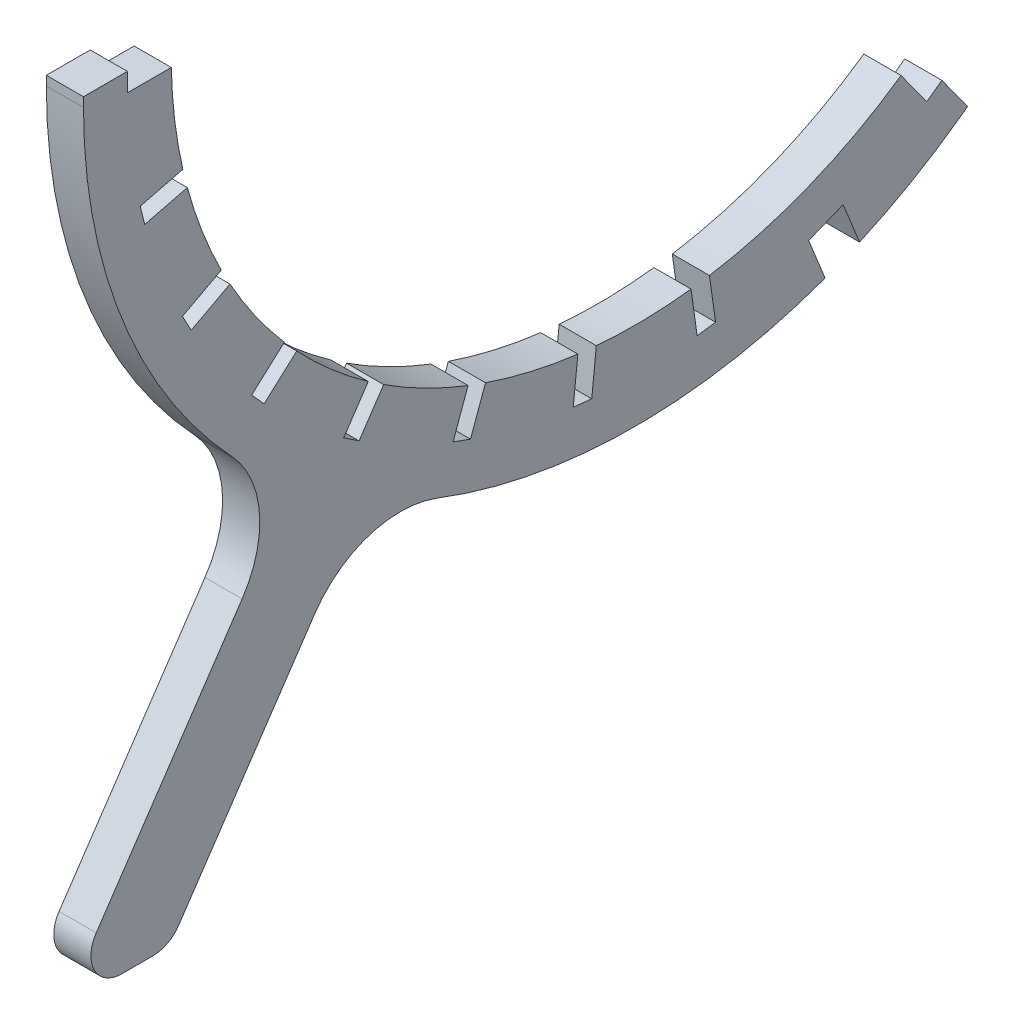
ISO-10303-21;
HEADER;
FILE_DESCRIPTION(('STEP AP214'),'2;1');
FILE_NAME('part.step','',(''),(''),'','','');
FILE_SCHEMA(('AUTOMOTIVE_DESIGN { 1 0 10303 214 1 1 1 1 }'));
ENDSEC;
DATA;
#1=APPLICATION_CONTEXT('core data for automotive mechanical design processes');
#2=APPLICATION_PROTOCOL_DEFINITION('international standard','automotive_design',2000,#1);
#3=PRODUCT_CONTEXT('',#1,'mechanical');
#4=PRODUCT('Part','Part','',(#3));
#5=PRODUCT_RELATED_PRODUCT_CATEGORY('part','',(#4));
#6=PRODUCT_DEFINITION_FORMATION('','',#4);
#7=PRODUCT_DEFINITION_CONTEXT('part definition',#1,'design');
#8=PRODUCT_DEFINITION('design','',#6,#7);
#9=PRODUCT_DEFINITION_SHAPE('','',#8);
#10=(LENGTH_UNIT() NAMED_UNIT(*) SI_UNIT(.MILLI.,.METRE.));
#11=(NAMED_UNIT(*) PLANE_ANGLE_UNIT() SI_UNIT($,.RADIAN.));
#12=(NAMED_UNIT(*) SI_UNIT($,.STERADIAN.) SOLID_ANGLE_UNIT());
#13=UNCERTAINTY_MEASURE_WITH_UNIT(LENGTH_MEASURE(1.E-05),#10,'distance_accuracy_value','');
#14=(GEOMETRIC_REPRESENTATION_CONTEXT(3) GLOBAL_UNCERTAINTY_ASSIGNED_CONTEXT((#13)) GLOBAL_UNIT_ASSIGNED_CONTEXT((#10,
#11,#12)) REPRESENTATION_CONTEXT('',''));
#15=CARTESIAN_POINT('',(0.,0.,0.));
#16=DIRECTION('',(0.,0.,1.));
#17=DIRECTION('',(1.,0.,0.));
#18=AXIS2_PLACEMENT_3D('',#15,#16,#17);
#19=CARTESIAN_POINT('',(18.,0.,0.));
#20=DIRECTION('',(-1.,0.,0.));
#21=DIRECTION('',(0.,0.,1.));
#22=AXIS2_PLACEMENT_3D('',#19,#20,#21);
#23=CYLINDRICAL_SURFACE('',#22,450.);
#24=CARTESIAN_POINT('',(-18.,0.,0.));
#25=DIRECTION('',(-1.,0.,0.));
#26=DIRECTION('',(0.,0.,-1.));
#27=AXIS2_PLACEMENT_3D('',#24,#25,#26);
#28=CIRCLE('',#27,450.);
#29=CARTESIAN_POINT('',(-18.,-294.360241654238,340.370457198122));
#30=VERTEX_POINT('',#29);
#31=CARTESIAN_POINT('',(-18.,-219.166474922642,393.021699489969));
#32=VERTEX_POINT('',#31);
#33=EDGE_CURVE('E381',#30,#32,#28,.T.);
#34=ORIENTED_EDGE('',*,*,#33,.T.);
#35=DIRECTION('',(-1.,0.,0.));
#36=VECTOR('',#35,1.);
#37=CARTESIAN_POINT('',(18.,-219.166474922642,393.021699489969));
#38=LINE('',#37,#36);
#39=CARTESIAN_POINT('',(18.,-219.166474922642,393.021699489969));
#40=VERTEX_POINT('',#39);
#41=EDGE_CURVE('E11',#40,#32,#38,.T.);
#42=ORIENTED_EDGE('',*,*,#41,.F.);
#43=CARTESIAN_POINT('',(18.,0.,0.));
#44=DIRECTION('',(-1.,0.,0.));
#45=DIRECTION('',(0.,0.,-1.));
#46=AXIS2_PLACEMENT_3D('',#43,#44,#45);
#47=CIRCLE('',#46,450.);
#48=CARTESIAN_POINT('',(18.,-294.360241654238,340.370457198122));
#49=VERTEX_POINT('',#48);
#50=EDGE_CURVE('E479',#49,#40,#47,.T.);
#51=ORIENTED_EDGE('',*,*,#50,.F.);
#52=DIRECTION('',(-1.,0.,0.));
#53=VECTOR('',#52,1.);
#54=CARTESIAN_POINT('',(18.,-294.360241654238,340.370457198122));
#55=LINE('',#54,#53);
#56=EDGE_CURVE('E377',#49,#30,#55,.T.);
#57=ORIENTED_EDGE('',*,*,#56,.T.);
#58=EDGE_LOOP('',(#34,#42,#51,#57));
#59=FACE_BOUND('',#58,.T.);
#60=ADVANCED_FACE('F33',(#59),#23,.F.);
#61=CARTESIAN_POINT('',(18.,-219.166474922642,393.021699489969));
#62=DIRECTION('',(0.,-0.882947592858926,-0.469471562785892));
#63=DIRECTION('',(0.,0.469471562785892,-0.882947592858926));
#64=AXIS2_PLACEMENT_3D('',#61,#62,#63);
#65=PLANE('',#64);
#66=DIRECTION('',(0.,-0.469471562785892,0.882947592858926));
#67=VECTOR('',#66,1.);
#68=CARTESIAN_POINT('',(-18.,-219.166474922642,393.021699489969));
#69=LINE('',#68,#67);
#70=CARTESIAN_POINT('',(-18.,-239.161273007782,430.626445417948));
#71=VERTEX_POINT('',#70);
#72=EDGE_CURVE('E384',#32,#71,#69,.T.);
#73=ORIENTED_EDGE('',*,*,#72,.T.);
#74=DIRECTION('',(-1.,0.,0.));
#75=VECTOR('',#74,1.);
#76=CARTESIAN_POINT('',(18.,-239.161273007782,430.626445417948));
#77=LINE('',#76,#75);
#78=CARTESIAN_POINT('',(18.,-239.161273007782,430.626445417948));
#79=VERTEX_POINT('',#78);
#80=EDGE_CURVE('E41',#79,#71,#77,.T.);
#81=ORIENTED_EDGE('',*,*,#80,.F.);
#82=DIRECTION('',(0.,-0.469471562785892,0.882947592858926));
#83=VECTOR('',#82,1.);
#84=CARTESIAN_POINT('',(18.,-219.166474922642,393.021699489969));
#85=LINE('',#84,#83);
#86=EDGE_CURVE('E218',#40,#79,#85,.T.);
#87=ORIENTED_EDGE('',*,*,#86,.F.);
#88=ORIENTED_EDGE('',*,*,#41,.T.);
#89=EDGE_LOOP('',(#73,#81,#87,#88));
#90=FACE_BOUND('',#89,.T.);
#91=ADVANCED_FACE('F747',(#90),#65,.F.);
#92=CARTESIAN_POINT('',(18.,-239.161273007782,430.626445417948));
#93=DIRECTION('',(0.,-0.469471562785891,0.882947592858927));
#94=DIRECTION('',(0.,-0.882947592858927,-0.469471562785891));
#95=AXIS2_PLACEMENT_3D('',#92,#93,#94);
#96=PLANE('',#95);
#97=DIRECTION('',(0.,0.882947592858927,0.469471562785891));
#98=VECTOR('',#97,1.);
#99=CARTESIAN_POINT('',(-18.,-239.161273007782,430.626445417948));
#100=LINE('',#99,#98);
#101=CARTESIAN_POINT('',(-18.,-223.268216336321,439.076933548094));
#102=VERTEX_POINT('',#101);
#103=EDGE_CURVE('E386',#71,#102,#100,.T.);
#104=ORIENTED_EDGE('',*,*,#103,.T.);
#105=DIRECTION('',(-1.,0.,0.));
#106=VECTOR('',#105,1.);
#107=CARTESIAN_POINT('',(18.,-223.268216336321,439.076933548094));
#108=LINE('',#107,#106);
#109=CARTESIAN_POINT('',(18.,-223.268216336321,439.076933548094));
#110=VERTEX_POINT('',#109);
#111=EDGE_CURVE('E612',#110,#102,#108,.T.);
#112=ORIENTED_EDGE('',*,*,#111,.F.);
#113=DIRECTION('',(0.,0.882947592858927,0.469471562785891));
#114=VECTOR('',#113,1.);
#115=CARTESIAN_POINT('',(18.,-239.161273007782,430.626445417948));
#116=LINE('',#115,#114);
#117=EDGE_CURVE('E620',#79,#110,#116,.T.);
#118=ORIENTED_EDGE('',*,*,#117,.F.);
#119=ORIENTED_EDGE('',*,*,#80,.T.);
#120=EDGE_LOOP('',(#104,#112,#118,#119));
#121=FACE_BOUND('',#120,.T.);
#122=ADVANCED_FACE('F618',(#121),#96,.F.);
#123=CARTESIAN_POINT('',(18.,-223.268216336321,439.076933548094));
#124=DIRECTION('',(0.,0.882947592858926,0.469471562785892));
#125=DIRECTION('',(0.,-0.469471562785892,0.882947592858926));
#126=AXIS2_PLACEMENT_3D('',#123,#124,#125);
#127=PLANE('',#126);
#128=DIRECTION('',(0.,0.469471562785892,-0.882947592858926));
#129=VECTOR('',#128,1.);
#130=CARTESIAN_POINT('',(-18.,-223.268216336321,439.076933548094));
#131=LINE('',#130,#129);
#132=CARTESIAN_POINT('',(-18.,-203.273418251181,401.472187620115));
#133=VERTEX_POINT('',#132);
#134=EDGE_CURVE('E388',#102,#133,#131,.T.);
#135=ORIENTED_EDGE('',*,*,#134,.T.);
#136=DIRECTION('',(-1.,0.,0.));
#137=VECTOR('',#136,1.);
#138=CARTESIAN_POINT('',(18.,-203.273418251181,401.472187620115));
#139=LINE('',#138,#137);
#140=CARTESIAN_POINT('',(18.,-203.273418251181,401.472187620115));
#141=VERTEX_POINT('',#140);
#142=EDGE_CURVE('E609',#141,#133,#139,.T.);
#143=ORIENTED_EDGE('',*,*,#142,.F.);
#144=DIRECTION('',(0.,0.469471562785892,-0.882947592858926));
#145=VECTOR('',#144,1.);
#146=CARTESIAN_POINT('',(18.,-223.268216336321,439.076933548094));
#147=LINE('',#146,#145);
#148=EDGE_CURVE('E638',#110,#141,#147,.T.);
#149=ORIENTED_EDGE('',*,*,#148,.F.);
#150=ORIENTED_EDGE('',*,*,#111,.T.);
#151=EDGE_LOOP('',(#135,#143,#149,#150));
#152=FACE_BOUND('',#151,.T.);
#153=ADVANCED_FACE('F629',(#152),#127,.F.);
#154=CARTESIAN_POINT('',(18.,0.,0.));
#155=DIRECTION('',(-1.,0.,0.));
#156=DIRECTION('',(0.,0.,1.));
#157=AXIS2_PLACEMENT_3D('',#154,#155,#156);
#158=CYLINDRICAL_SURFACE('',#157,450.);
#159=CARTESIAN_POINT('',(-18.,0.,0.));
#160=DIRECTION('',(-1.,0.,0.));
#161=DIRECTION('',(0.,0.,-1.));
#162=AXIS2_PLACEMENT_3D('',#159,#160,#161);
#163=CIRCLE('',#162,450.);
#164=CARTESIAN_POINT('',(-18.,-117.575739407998,434.368444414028));
#165=VERTEX_POINT('',#164);
#166=EDGE_CURVE('E390',#133,#165,#163,.T.);
#167=ORIENTED_EDGE('',*,*,#166,.T.);
#168=DIRECTION('',(-1.,0.,0.));
#169=VECTOR('',#168,1.);
#170=CARTESIAN_POINT('',(18.,-117.575739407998,434.368444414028));
#171=LINE('',#170,#169);
#172=CARTESIAN_POINT('',(18.,-117.575739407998,434.368444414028));
#173=VERTEX_POINT('',#172);
#174=EDGE_CURVE('E606',#173,#165,#171,.T.);
#175=ORIENTED_EDGE('',*,*,#174,.F.);
#176=CARTESIAN_POINT('',(18.,0.,0.));
#177=DIRECTION('',(-1.,0.,0.));
#178=DIRECTION('',(0.,0.,-1.));
#179=AXIS2_PLACEMENT_3D('',#176,#177,#178);
#180=CIRCLE('',#179,450.);
#181=EDGE_CURVE('E635',#141,#173,#180,.T.);
#182=ORIENTED_EDGE('',*,*,#181,.F.);
#183=ORIENTED_EDGE('',*,*,#142,.T.);
#184=EDGE_LOOP('',(#167,#175,#182,#183));
#185=FACE_BOUND('',#184,.T.);
#186=ADVANCED_FACE('F633',(#185),#158,.F.);
#187=CARTESIAN_POINT('',(18.,-117.575739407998,434.368444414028));
#188=DIRECTION('',(0.,-0.970295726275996,-0.241921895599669));
#189=DIRECTION('',(0.,0.241921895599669,-0.970295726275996));
#190=AXIS2_PLACEMENT_3D('',#187,#188,#189);
#191=PLANE('',#190);
#192=DIRECTION('',(0.,-0.241921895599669,0.970295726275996));
#193=VECTOR('',#192,1.);
#194=CARTESIAN_POINT('',(-18.,-117.575739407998,434.368444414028));
#195=LINE('',#194,#193);
#196=CARTESIAN_POINT('',(-18.,-127.879195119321,475.693348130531));
#197=VERTEX_POINT('',#196);
#198=EDGE_CURVE('E392',#165,#197,#195,.T.);
#199=ORIENTED_EDGE('',*,*,#198,.T.);
#200=DIRECTION('',(-1.,0.,0.));
#201=VECTOR('',#200,1.);
#202=CARTESIAN_POINT('',(18.,-127.879195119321,475.693348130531));
#203=LINE('',#202,#201);
#204=CARTESIAN_POINT('',(18.,-127.879195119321,475.693348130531));
#205=VERTEX_POINT('',#204);
#206=EDGE_CURVE('E603',#205,#197,#203,.T.);
#207=ORIENTED_EDGE('',*,*,#206,.F.);
#208=DIRECTION('',(0.,-0.241921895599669,0.970295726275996));
#209=VECTOR('',#208,1.);
#210=CARTESIAN_POINT('',(18.,-117.575739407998,434.368444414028));
#211=LINE('',#210,#209);
#212=EDGE_CURVE('E637',#173,#205,#211,.T.);
#213=ORIENTED_EDGE('',*,*,#212,.F.);
#214=ORIENTED_EDGE('',*,*,#174,.T.);
#215=EDGE_LOOP('',(#199,#207,#213,#214));
#216=FACE_BOUND('',#215,.T.);
#217=ADVANCED_FACE('F760',(#216),#191,.F.);
#218=CARTESIAN_POINT('',(18.,-127.879195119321,475.693348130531));
#219=DIRECTION('',(0.,-0.241921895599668,0.970295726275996));
#220=DIRECTION('',(0.,-0.970295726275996,-0.241921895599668));
#221=AXIS2_PLACEMENT_3D('',#218,#219,#220);
#222=PLANE('',#221);
#223=DIRECTION('',(0.,0.970295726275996,0.241921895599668));
#224=VECTOR('',#223,1.);
#225=CARTESIAN_POINT('',(-18.,-127.879195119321,475.693348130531));
#226=LINE('',#225,#224);
#227=CARTESIAN_POINT('',(-18.,-110.413872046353,480.047942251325));
#228=VERTEX_POINT('',#227);
#229=EDGE_CURVE('E394',#197,#228,#226,.T.);
#230=ORIENTED_EDGE('',*,*,#229,.T.);
#231=DIRECTION('',(-1.,0.,0.));
#232=VECTOR('',#231,1.);
#233=CARTESIAN_POINT('',(18.,-110.413872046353,480.047942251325));
#234=LINE('',#233,#232);
#235=CARTESIAN_POINT('',(18.,-110.413872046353,480.047942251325));
#236=VERTEX_POINT('',#235);
#237=EDGE_CURVE('E600',#236,#228,#234,.T.);
#238=ORIENTED_EDGE('',*,*,#237,.F.);
#239=DIRECTION('',(0.,0.970295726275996,0.241921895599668));
#240=VECTOR('',#239,1.);
#241=CARTESIAN_POINT('',(18.,-127.879195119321,475.693348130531));
#242=LINE('',#241,#240);
#243=EDGE_CURVE('E640',#205,#236,#242,.T.);
#244=ORIENTED_EDGE('',*,*,#243,.F.);
#245=ORIENTED_EDGE('',*,*,#206,.T.);
#246=EDGE_LOOP('',(#230,#238,#244,#245));
#247=FACE_BOUND('',#246,.T.);
#248=ADVANCED_FACE('F763',(#247),#222,.F.);
#249=CARTESIAN_POINT('',(18.,-110.413872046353,480.047942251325));
#250=DIRECTION('',(0.,0.970295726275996,0.241921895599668));
#251=DIRECTION('',(0.,-0.241921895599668,0.970295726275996));
#252=AXIS2_PLACEMENT_3D('',#249,#250,#251);
#253=PLANE('',#252);
#254=DIRECTION('',(0.,0.241921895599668,-0.970295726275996));
#255=VECTOR('',#254,1.);
#256=CARTESIAN_POINT('',(-18.,-110.413872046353,480.047942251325));
#257=LINE('',#256,#255);
#258=CARTESIAN_POINT('',(-18.,-100.11041633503,438.723038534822));
#259=VERTEX_POINT('',#258);
#260=EDGE_CURVE('E396',#228,#259,#257,.T.);
#261=ORIENTED_EDGE('',*,*,#260,.T.);
#262=DIRECTION('',(-1.,0.,0.));
#263=VECTOR('',#262,1.);
#264=CARTESIAN_POINT('',(18.,-100.11041633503,438.723038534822));
#265=LINE('',#264,#263);
#266=CARTESIAN_POINT('',(18.,-100.11041633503,438.723038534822));
#267=VERTEX_POINT('',#266);
#268=EDGE_CURVE('E597',#267,#259,#265,.T.);
#269=ORIENTED_EDGE('',*,*,#268,.F.);
#270=DIRECTION('',(0.,0.241921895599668,-0.970295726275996));
#271=VECTOR('',#270,1.);
#272=CARTESIAN_POINT('',(18.,-110.413872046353,480.047942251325));
#273=LINE('',#272,#271);
#274=EDGE_CURVE('E646',#236,#267,#273,.T.);
#275=ORIENTED_EDGE('',*,*,#274,.F.);
#276=ORIENTED_EDGE('',*,*,#237,.T.);
#277=EDGE_LOOP('',(#261,#269,#275,#276));
#278=FACE_BOUND('',#277,.T.);
#279=ADVANCED_FACE('F767',(#278),#253,.F.);
#280=CARTESIAN_POINT('',(18.,0.,0.));
#281=DIRECTION('',(-1.,0.,0.));
#282=DIRECTION('',(0.,0.,1.));
#283=AXIS2_PLACEMENT_3D('',#280,#281,#282);
#284=CYLINDRICAL_SURFACE('',#283,450.);
#285=CARTESIAN_POINT('',(-18.,0.,0.));
#286=DIRECTION('',(-1.,0.,0.));
#287=DIRECTION('',(0.,0.,-1.));
#288=AXIS2_PLACEMENT_3D('',#285,#286,#287);
#289=CIRCLE('',#288,450.);
#290=CARTESIAN_POINT('',(-18.,-9.,449.9099909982));
#291=VERTEX_POINT('',#290);
#292=EDGE_CURVE('E398',#259,#291,#289,.T.);
#293=ORIENTED_EDGE('',*,*,#292,.T.);
#294=DIRECTION('',(-1.,0.,0.));
#295=VECTOR('',#294,1.);
#296=CARTESIAN_POINT('',(18.,-9.,449.9099909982));
#297=LINE('',#296,#295);
#298=CARTESIAN_POINT('',(18.,-9.,449.9099909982));
#299=VERTEX_POINT('',#298);
#300=EDGE_CURVE('E594',#299,#291,#297,.T.);
#301=ORIENTED_EDGE('',*,*,#300,.F.);
#302=CARTESIAN_POINT('',(18.,0.,0.));
#303=DIRECTION('',(-1.,0.,0.));
#304=DIRECTION('',(0.,0.,-1.));
#305=AXIS2_PLACEMENT_3D('',#302,#303,#304);
#306=CIRCLE('',#305,450.);
#307=EDGE_CURVE('E648',#267,#299,#306,.T.);
#308=ORIENTED_EDGE('',*,*,#307,.F.);
#309=ORIENTED_EDGE('',*,*,#268,.T.);
#310=EDGE_LOOP('',(#293,#301,#308,#309));
#311=FACE_BOUND('',#310,.T.);
#312=ADVANCED_FACE('F771',(#311),#284,.F.);
#313=CARTESIAN_POINT('',(18.,-9.,449.9099909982));
#314=DIRECTION('',(0.,-1.,0.));
#315=DIRECTION('',(0.,0.,-1.));
#316=AXIS2_PLACEMENT_3D('',#313,#314,#315);
#317=PLANE('',#316);
#318=DIRECTION('',(0.,0.,1.));
#319=VECTOR('',#318,1.);
#320=CARTESIAN_POINT('',(-18.,-9.,449.9099909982));
#321=LINE('',#320,#319);
#322=CARTESIAN_POINT('',(-18.,-9.00000000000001,492.5));
#323=VERTEX_POINT('',#322);
#324=EDGE_CURVE('E400',#291,#323,#321,.T.);
#325=ORIENTED_EDGE('',*,*,#324,.T.);
#326=DIRECTION('',(-1.,0.,0.));
#327=VECTOR('',#326,1.);
#328=CARTESIAN_POINT('',(18.,-9.00000000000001,492.5));
#329=LINE('',#328,#327);
#330=CARTESIAN_POINT('',(18.,-9.00000000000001,492.5));
#331=VERTEX_POINT('',#330);
#332=EDGE_CURVE('E591',#331,#323,#329,.T.);
#333=ORIENTED_EDGE('',*,*,#332,.F.);
#334=DIRECTION('',(0.,0.,1.));
#335=VECTOR('',#334,1.);
#336=CARTESIAN_POINT('',(18.,-9.,449.9099909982));
#337=LINE('',#336,#335);
#338=EDGE_CURVE('E650',#299,#331,#337,.T.);
#339=ORIENTED_EDGE('',*,*,#338,.F.);
#340=ORIENTED_EDGE('',*,*,#300,.T.);
#341=EDGE_LOOP('',(#325,#333,#339,#340));
#342=FACE_BOUND('',#341,.T.);
#343=ADVANCED_FACE('F775',(#342),#317,.F.);
#344=CARTESIAN_POINT('',(18.,-9.00000000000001,492.5));
#345=DIRECTION('',(0.,0.,1.));
#346=DIRECTION('',(1.,0.,0.));
#347=AXIS2_PLACEMENT_3D('',#344,#345,#346);
#348=PLANE('',#347);
#349=DIRECTION('',(0.,1.,0.));
#350=VECTOR('',#349,1.);
#351=CARTESIAN_POINT('',(-18.,-9.00000000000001,492.5));
#352=LINE('',#351,#350);
#353=CARTESIAN_POINT('',(-18.,9.,492.5));
#354=VERTEX_POINT('',#353);
#355=EDGE_CURVE('E402',#323,#354,#352,.T.);
#356=ORIENTED_EDGE('',*,*,#355,.T.);
#357=DIRECTION('',(-1.,0.,0.));
#358=VECTOR('',#357,1.);
#359=CARTESIAN_POINT('',(18.,9.,492.5));
#360=LINE('',#359,#358);
#361=CARTESIAN_POINT('',(18.,9.,492.5));
#362=VERTEX_POINT('',#361);
#363=EDGE_CURVE('E588',#362,#354,#360,.T.);
#364=ORIENTED_EDGE('',*,*,#363,.F.);
#365=DIRECTION('',(0.,1.,0.));
#366=VECTOR('',#365,1.);
#367=CARTESIAN_POINT('',(18.,-9.00000000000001,492.5));
#368=LINE('',#367,#366);
#369=EDGE_CURVE('E652',#331,#362,#368,.T.);
#370=ORIENTED_EDGE('',*,*,#369,.F.);
#371=ORIENTED_EDGE('',*,*,#332,.T.);
#372=EDGE_LOOP('',(#356,#364,#370,#371));
#373=FACE_BOUND('',#372,.T.);
#374=ADVANCED_FACE('F779',(#373),#348,.F.);
#375=CARTESIAN_POINT('',(18.,9.,492.5));
#376=DIRECTION('',(0.,-1.,0.));
#377=DIRECTION('',(0.,0.,-1.));
#378=AXIS2_PLACEMENT_3D('',#375,#376,#377);
#379=PLANE('',#378);
#380=DIRECTION('',(0.,0.,1.));
#381=VECTOR('',#380,1.);
#382=CARTESIAN_POINT('',(-18.,9.,492.5));
#383=LINE('',#382,#381);
#384=CARTESIAN_POINT('',(-18.,9.,535.));
#385=VERTEX_POINT('',#384);
#386=EDGE_CURVE('E404',#354,#385,#383,.T.);
#387=ORIENTED_EDGE('',*,*,#386,.T.);
#388=DIRECTION('',(-1.,0.,0.));
#389=VECTOR('',#388,1.);
#390=CARTESIAN_POINT('',(18.,9.,535.));
#391=LINE('',#390,#389);
#392=CARTESIAN_POINT('',(18.,9.,535.));
#393=VERTEX_POINT('',#392);
#394=EDGE_CURVE('E585',#393,#385,#391,.T.);
#395=ORIENTED_EDGE('',*,*,#394,.F.);
#396=DIRECTION('',(0.,0.,1.));
#397=VECTOR('',#396,1.);
#398=CARTESIAN_POINT('',(18.,9.,492.5));
#399=LINE('',#398,#397);
#400=EDGE_CURVE('E654',#362,#393,#399,.T.);
#401=ORIENTED_EDGE('',*,*,#400,.F.);
#402=ORIENTED_EDGE('',*,*,#363,.T.);
#403=EDGE_LOOP('',(#387,#395,#401,#402));
#404=FACE_BOUND('',#403,.T.);
#405=ADVANCED_FACE('F783',(#404),#379,.F.);
#406=CARTESIAN_POINT('',(18.,9.,535.));
#407=DIRECTION('',(0.,0.,-1.));
#408=DIRECTION('',(-1.,0.,0.));
#409=AXIS2_PLACEMENT_3D('',#406,#407,#408);
#410=PLANE('',#409);
#411=DIRECTION('',(0.,-1.,0.));
#412=VECTOR('',#411,1.);
#413=CARTESIAN_POINT('',(-18.,9.,535.));
#414=LINE('',#413,#412);
#415=CARTESIAN_POINT('',(-18.,0.,535.));
#416=VERTEX_POINT('',#415);
#417=EDGE_CURVE('E406',#385,#416,#414,.T.);
#418=ORIENTED_EDGE('',*,*,#417,.T.);
#419=DIRECTION('',(-1.,0.,0.));
#420=VECTOR('',#419,1.);
#421=CARTESIAN_POINT('',(18.,0.,535.));
#422=LINE('',#421,#420);
#423=CARTESIAN_POINT('',(18.,0.,535.));
#424=VERTEX_POINT('',#423);
#425=EDGE_CURVE('E582',#424,#416,#422,.T.);
#426=ORIENTED_EDGE('',*,*,#425,.F.);
#427=DIRECTION('',(0.,-1.,0.));
#428=VECTOR('',#427,1.);
#429=CARTESIAN_POINT('',(18.,9.,535.));
#430=LINE('',#429,#428);
#431=EDGE_CURVE('E656',#393,#424,#430,.T.);
#432=ORIENTED_EDGE('',*,*,#431,.F.);
#433=ORIENTED_EDGE('',*,*,#394,.T.);
#434=EDGE_LOOP('',(#418,#426,#432,#433));
#435=FACE_BOUND('',#434,.T.);
#436=ADVANCED_FACE('F787',(#435),#410,.F.);
#437=CARTESIAN_POINT('',(18.,0.,0.));
#438=DIRECTION('',(-1.,0.,0.));
#439=DIRECTION('',(0.,0.,1.));
#440=AXIS2_PLACEMENT_3D('',#437,#438,#439);
#441=CYLINDRICAL_SURFACE('',#440,535.);
#442=CARTESIAN_POINT('',(-18.,0.,0.));
#443=DIRECTION('',(1.,0.,0.));
#444=DIRECTION('',(0.,0.,-1.));
#445=AXIS2_PLACEMENT_3D('',#442,#443,#444);
#446=CIRCLE('',#445,535.);
#447=CARTESIAN_POINT('',(-18.,-365.086542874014,391.071369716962));
#448=VERTEX_POINT('',#447);
#449=EDGE_CURVE('E408',#416,#448,#446,.T.);
#450=ORIENTED_EDGE('',*,*,#449,.T.);
#451=DIRECTION('',(-1.,0.,0.));
#452=VECTOR('',#451,1.);
#453=CARTESIAN_POINT('',(18.,-365.086542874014,391.071369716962));
#454=LINE('',#453,#452);
#455=CARTESIAN_POINT('',(18.,-365.086542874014,391.071369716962));
#456=VERTEX_POINT('',#455);
#457=EDGE_CURVE('E579',#456,#448,#454,.T.);
#458=ORIENTED_EDGE('',*,*,#457,.F.);
#459=CARTESIAN_POINT('',(18.,0.,0.));
#460=DIRECTION('',(1.,0.,0.));
#461=DIRECTION('',(0.,0.,-1.));
#462=AXIS2_PLACEMENT_3D('',#459,#460,#461);
#463=CIRCLE('',#462,535.);
#464=EDGE_CURVE('E658',#424,#456,#463,.T.);
#465=ORIENTED_EDGE('',*,*,#464,.F.);
#466=ORIENTED_EDGE('',*,*,#425,.T.);
#467=EDGE_LOOP('',(#450,#458,#465,#466));
#468=FACE_BOUND('',#467,.T.);
#469=ADVANCED_FACE('F791',(#468),#441,.T.);
#470=CARTESIAN_POINT('',(18.,-433.327018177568,464.168822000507));
#471=DIRECTION('',(-1.,0.,0.));
#472=DIRECTION('',(0.,0.,1.));
#473=AXIS2_PLACEMENT_3D('',#470,#471,#472);
#474=CYLINDRICAL_SURFACE('',#473,100.);
#475=CARTESIAN_POINT('',(-18.,-433.327018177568,464.168822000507));
#476=DIRECTION('',(-1.,0.,0.));
#477=DIRECTION('',(0.,0.,-1.));
#478=AXIS2_PLACEMENT_3D('',#475,#476,#477);
#479=CIRCLE('',#478,100.);
#480=CARTESIAN_POINT('',(-18.,-489.246308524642,381.265064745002));
#481=VERTEX_POINT('',#480);
#482=EDGE_CURVE('E410',#448,#481,#479,.T.);
#483=ORIENTED_EDGE('',*,*,#482,.T.);
#484=DIRECTION('',(-1.,0.,0.));
#485=VECTOR('',#484,1.);
#486=CARTESIAN_POINT('',(18.,-489.246308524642,381.265064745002));
#487=LINE('',#486,#485);
#488=CARTESIAN_POINT('',(18.,-489.246308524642,381.265064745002));
#489=VERTEX_POINT('',#488);
#490=EDGE_CURVE('E576',#489,#481,#487,.T.);
#491=ORIENTED_EDGE('',*,*,#490,.F.);
#492=CARTESIAN_POINT('',(18.,-433.327018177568,464.168822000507));
#493=DIRECTION('',(-1.,0.,0.));
#494=DIRECTION('',(0.,0.,-1.));
#495=AXIS2_PLACEMENT_3D('',#492,#493,#494);
#496=CIRCLE('',#495,100.);
#497=EDGE_CURVE('E660',#456,#489,#496,.T.);
#498=ORIENTED_EDGE('',*,*,#497,.F.);
#499=ORIENTED_EDGE('',*,*,#457,.T.);
#500=EDGE_LOOP('',(#483,#491,#498,#499));
#501=FACE_BOUND('',#500,.T.);
#502=ADVANCED_FACE('F795',(#501),#474,.F.);
#503=CARTESIAN_POINT('',(18.,-489.246308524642,381.265064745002));
#504=DIRECTION('',(0.,-0.559192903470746,-0.829037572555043));
#505=DIRECTION('',(0.,0.829037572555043,-0.559192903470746));
#506=AXIS2_PLACEMENT_3D('',#503,#504,#505);
#507=PLANE('',#506);
#508=DIRECTION('',(0.,-0.829037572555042,0.559192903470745));
#509=VECTOR('',#508,1.);
#510=CARTESIAN_POINT('',(-18.,-489.246308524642,381.265064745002));
#511=LINE('',#510,#509);
#512=CARTESIAN_POINT('',(-18.,-698.844843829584,522.641061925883));
#513=VERTEX_POINT('',#512);
#514=EDGE_CURVE('E412',#481,#513,#511,.T.);
#515=ORIENTED_EDGE('',*,*,#514,.T.);
#516=DIRECTION('',(-1.,0.,0.));
#517=VECTOR('',#516,1.);
#518=CARTESIAN_POINT('',(18.,-698.844843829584,522.641061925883));
#519=LINE('',#518,#517);
#520=CARTESIAN_POINT('',(18.,-698.844843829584,522.641061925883));
#521=VERTEX_POINT('',#520);
#522=EDGE_CURVE('E573',#521,#513,#519,.T.);
#523=ORIENTED_EDGE('',*,*,#522,.F.);
#524=DIRECTION('',(0.,-0.829037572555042,0.559192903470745));
#525=VECTOR('',#524,1.);
#526=CARTESIAN_POINT('',(18.,-489.246308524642,381.265064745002));
#527=LINE('',#526,#525);
#528=EDGE_CURVE('E662',#489,#521,#527,.T.);
#529=ORIENTED_EDGE('',*,*,#528,.F.);
#530=ORIENTED_EDGE('',*,*,#490,.T.);
#531=EDGE_LOOP('',(#515,#523,#529,#530));
#532=FACE_BOUND('',#531,.T.);
#533=ADVANCED_FACE('F799',(#532),#507,.F.);
#534=CARTESIAN_POINT('',(18.,-715.620630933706,497.769934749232));
#535=DIRECTION('',(-1.,0.,0.));
#536=DIRECTION('',(0.,0.,1.));
#537=AXIS2_PLACEMENT_3D('',#534,#535,#536);
#538=CYLINDRICAL_SURFACE('',#537,30.);
#539=CARTESIAN_POINT('',(-18.,-715.620630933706,497.769934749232));
#540=DIRECTION('',(1.,0.,0.));
#541=DIRECTION('',(0.,0.,-1.));
#542=AXIS2_PLACEMENT_3D('',#539,#540,#541);
#543=CIRCLE('',#542,30.);
#544=CARTESIAN_POINT('',(-18.,-745.620630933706,497.769934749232));
#545=VERTEX_POINT('',#544);
#546=EDGE_CURVE('E414',#513,#545,#543,.T.);
#547=ORIENTED_EDGE('',*,*,#546,.T.);
#548=DIRECTION('',(-1.,0.,0.));
#549=VECTOR('',#548,1.);
#550=CARTESIAN_POINT('',(18.,-745.620630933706,497.769934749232));
#551=LINE('',#550,#549);
#552=CARTESIAN_POINT('',(18.,-745.620630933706,497.769934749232));
#553=VERTEX_POINT('',#552);
#554=EDGE_CURVE('E570',#553,#545,#551,.T.);
#555=ORIENTED_EDGE('',*,*,#554,.F.);
#556=CARTESIAN_POINT('',(18.,-715.620630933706,497.769934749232));
#557=DIRECTION('',(1.,0.,0.));
#558=DIRECTION('',(0.,0.,-1.));
#559=AXIS2_PLACEMENT_3D('',#556,#557,#558);
#560=CIRCLE('',#559,30.);
#561=EDGE_CURVE('E664',#521,#553,#560,.T.);
#562=ORIENTED_EDGE('',*,*,#561,.F.);
#563=ORIENTED_EDGE('',*,*,#522,.T.);
#564=EDGE_LOOP('',(#547,#555,#562,#563));
#565=FACE_BOUND('',#564,.T.);
#566=ADVANCED_FACE('F803',(#565),#538,.T.);
#567=CARTESIAN_POINT('',(18.,-745.620630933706,497.769934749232));
#568=DIRECTION('',(0.,1.,0.));
#569=DIRECTION('',(0.,0.,1.));
#570=AXIS2_PLACEMENT_3D('',#567,#568,#569);
#571=PLANE('',#570);
#572=DIRECTION('',(0.,0.,-1.));
#573=VECTOR('',#572,1.);
#574=CARTESIAN_POINT('',(-18.,-745.620630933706,497.769934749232));
#575=LINE('',#574,#573);
#576=CARTESIAN_POINT('',(-18.,-745.620630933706,467.614486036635));
#577=VERTEX_POINT('',#576);
#578=EDGE_CURVE('E416',#545,#577,#575,.T.);
#579=ORIENTED_EDGE('',*,*,#578,.T.);
#580=DIRECTION('',(-1.,0.,0.));
#581=VECTOR('',#580,1.);
#582=CARTESIAN_POINT('',(18.,-745.620630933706,467.614486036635));
#583=LINE('',#582,#581);
#584=CARTESIAN_POINT('',(18.,-745.620630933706,467.614486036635));
#585=VERTEX_POINT('',#584);
#586=EDGE_CURVE('E567',#585,#577,#583,.T.);
#587=ORIENTED_EDGE('',*,*,#586,.F.);
#588=DIRECTION('',(0.,0.,-1.));
#589=VECTOR('',#588,1.);
#590=CARTESIAN_POINT('',(18.,-745.620630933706,497.769934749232));
#591=LINE('',#590,#589);
#592=EDGE_CURVE('E666',#553,#585,#591,.T.);
#593=ORIENTED_EDGE('',*,*,#592,.F.);
#594=ORIENTED_EDGE('',*,*,#554,.T.);
#595=EDGE_LOOP('',(#579,#587,#593,#594));
#596=FACE_BOUND('',#595,.T.);
#597=ADVANCED_FACE('F807',(#596),#571,.F.);
#598=CARTESIAN_POINT('',(18.,-715.620630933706,467.614486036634));
#599=DIRECTION('',(-1.,0.,0.));
#600=DIRECTION('',(0.,0.,1.));
#601=AXIS2_PLACEMENT_3D('',#598,#599,#600);
#602=CYLINDRICAL_SURFACE('',#601,30.);
#603=CARTESIAN_POINT('',(-18.,-715.620630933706,467.614486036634));
#604=DIRECTION('',(1.,0.,0.));
#605=DIRECTION('',(0.,0.,1.));
#606=AXIS2_PLACEMENT_3D('',#603,#604,#605);
#607=CIRCLE('',#606,30.);
#608=CARTESIAN_POINT('',(-18.,-732.396418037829,442.743358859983));
#609=VERTEX_POINT('',#608);
#610=EDGE_CURVE('E418',#577,#609,#607,.T.);
#611=ORIENTED_EDGE('',*,*,#610,.T.);
#612=DIRECTION('',(-1.,0.,0.));
#613=VECTOR('',#612,1.);
#614=CARTESIAN_POINT('',(18.,-732.396418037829,442.743358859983));
#615=LINE('',#614,#613);
#616=CARTESIAN_POINT('',(18.,-732.396418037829,442.743358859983));
#617=VERTEX_POINT('',#616);
#618=EDGE_CURVE('E564',#617,#609,#615,.T.);
#619=ORIENTED_EDGE('',*,*,#618,.F.);
#620=CARTESIAN_POINT('',(18.,-715.620630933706,467.614486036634));
#621=DIRECTION('',(1.,0.,0.));
#622=DIRECTION('',(0.,0.,1.));
#623=AXIS2_PLACEMENT_3D('',#620,#621,#622);
#624=CIRCLE('',#623,30.);
#625=EDGE_CURVE('E668',#585,#617,#624,.T.);
#626=ORIENTED_EDGE('',*,*,#625,.F.);
#627=ORIENTED_EDGE('',*,*,#586,.T.);
#628=EDGE_LOOP('',(#611,#619,#626,#627));
#629=FACE_BOUND('',#628,.T.);
#630=ADVANCED_FACE('F811',(#629),#602,.T.);
#631=CARTESIAN_POINT('',(18.,-536.777705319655,310.796871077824));
#632=DIRECTION('',(0.,0.559192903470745,0.829037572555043));
#633=DIRECTION('',(0.,-0.829037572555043,0.559192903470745));
#634=AXIS2_PLACEMENT_3D('',#631,#632,#633);
#635=PLANE('',#634);
#636=DIRECTION('',(0.,0.829037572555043,-0.559192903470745));
#637=VECTOR('',#636,1.);
#638=CARTESIAN_POINT('',(-18.,-536.777705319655,310.796871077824));
#639=LINE('',#638,#637);
#640=CARTESIAN_POINT('',(-18.,-536.777705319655,310.796871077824));
#641=VERTEX_POINT('',#640);
#642=EDGE_CURVE('E420',#609,#641,#639,.T.);
#643=ORIENTED_EDGE('',*,*,#642,.T.);
#644=DIRECTION('',(-1.,0.,0.));
#645=VECTOR('',#644,1.);
#646=CARTESIAN_POINT('',(18.,-536.777705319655,310.796871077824));
#647=LINE('',#646,#645);
#648=CARTESIAN_POINT('',(18.,-536.777705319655,310.796871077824));
#649=VERTEX_POINT('',#648);
#650=EDGE_CURVE('E561',#649,#641,#647,.T.);
#651=ORIENTED_EDGE('',*,*,#650,.F.);
#652=DIRECTION('',(0.,0.829037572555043,-0.559192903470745));
#653=VECTOR('',#652,1.);
#654=CARTESIAN_POINT('',(18.,-536.777705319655,310.796871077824));
#655=LINE('',#654,#653);
#656=EDGE_CURVE('E670',#617,#649,#655,.T.);
#657=ORIENTED_EDGE('',*,*,#656,.F.);
#658=ORIENTED_EDGE('',*,*,#618,.T.);
#659=EDGE_LOOP('',(#643,#651,#657,#658));
#660=FACE_BOUND('',#659,.T.);
#661=ADVANCED_FACE('F815',(#660),#635,.F.);
#662=CARTESIAN_POINT('',(18.,-592.69699566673,227.893113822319));
#663=DIRECTION('',(-1.,0.,0.));
#664=DIRECTION('',(0.,0.,1.));
#665=AXIS2_PLACEMENT_3D('',#662,#663,#664);
#666=CYLINDRICAL_SURFACE('',#665,99.9999999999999);
#667=CARTESIAN_POINT('',(-18.,-592.69699566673,227.893113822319));
#668=DIRECTION('',(-1.,0.,0.));
#669=DIRECTION('',(0.,0.,1.));
#670=AXIS2_PLACEMENT_3D('',#667,#668,#669);
#671=CIRCLE('',#670,99.9999999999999);
#672=CARTESIAN_POINT('',(-18.,-499.358886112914,192.004434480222));
#673=VERTEX_POINT('',#672);
#674=EDGE_CURVE('E422',#641,#673,#671,.T.);
#675=ORIENTED_EDGE('',*,*,#674,.T.);
#676=DIRECTION('',(-1.,0.,0.));
#677=VECTOR('',#676,1.);
#678=CARTESIAN_POINT('',(18.,-499.358886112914,192.004434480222));
#679=LINE('',#678,#677);
#680=CARTESIAN_POINT('',(18.,-499.358886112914,192.004434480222));
#681=VERTEX_POINT('',#680);
#682=EDGE_CURVE('E558',#681,#673,#679,.T.);
#683=ORIENTED_EDGE('',*,*,#682,.F.);
#684=CARTESIAN_POINT('',(18.,-592.69699566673,227.893113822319));
#685=DIRECTION('',(-1.,0.,0.));
#686=DIRECTION('',(0.,0.,1.));
#687=AXIS2_PLACEMENT_3D('',#684,#685,#686);
#688=CIRCLE('',#687,99.9999999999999);
#689=EDGE_CURVE('E672',#649,#681,#688,.T.);
#690=ORIENTED_EDGE('',*,*,#689,.F.);
#691=ORIENTED_EDGE('',*,*,#650,.T.);
#692=EDGE_LOOP('',(#675,#683,#690,#691));
#693=FACE_BOUND('',#692,.T.);
#694=ADVANCED_FACE('F819',(#693),#666,.F.);
#695=CARTESIAN_POINT('',(18.,0.,0.));
#696=DIRECTION('',(-1.,0.,0.));
#697=DIRECTION('',(0.,0.,1.));
#698=AXIS2_PLACEMENT_3D('',#695,#696,#697);
#699=CYLINDRICAL_SURFACE('',#698,535.);
#700=CARTESIAN_POINT('',(-18.,0.,0.));
#701=DIRECTION('',(1.,0.,0.));
#702=DIRECTION('',(0.,0.,-1.));
#703=AXIS2_PLACEMENT_3D('',#700,#701,#702);
#704=CIRCLE('',#703,535.);
#705=CARTESIAN_POINT('',(-18.,-502.505446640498,-183.611753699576));
#706=VERTEX_POINT('',#705);
#707=EDGE_CURVE('E424',#673,#706,#704,.T.);
#708=ORIENTED_EDGE('',*,*,#707,.T.);
#709=DIRECTION('',(-1.,0.,0.));
#710=VECTOR('',#709,1.);
#711=CARTESIAN_POINT('',(18.,-502.505446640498,-183.611753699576));
#712=LINE('',#711,#710);
#713=CARTESIAN_POINT('',(18.,-502.505446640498,-183.611753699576));
#714=VERTEX_POINT('',#713);
#715=EDGE_CURVE('E555',#714,#706,#712,.T.);
#716=ORIENTED_EDGE('',*,*,#715,.F.);
#717=CARTESIAN_POINT('',(18.,0.,0.));
#718=DIRECTION('',(1.,0.,0.));
#719=DIRECTION('',(0.,0.,-1.));
#720=AXIS2_PLACEMENT_3D('',#717,#718,#719);
#721=CIRCLE('',#720,535.);
#722=EDGE_CURVE('E674',#681,#714,#721,.T.);
#723=ORIENTED_EDGE('',*,*,#722,.F.);
#724=ORIENTED_EDGE('',*,*,#682,.T.);
#725=EDGE_LOOP('',(#708,#716,#723,#724));
#726=FACE_BOUND('',#725,.T.);
#727=ADVANCED_FACE('F823',(#726),#699,.T.);
#728=CARTESIAN_POINT('',(18.,-502.505446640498,-183.611753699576));
#729=DIRECTION('',(0.,-0.374606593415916,0.927183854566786));
#730=DIRECTION('',(0.,-0.927183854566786,-0.374606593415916));
#731=AXIS2_PLACEMENT_3D('',#728,#729,#730);
#732=PLANE('',#731);
#733=DIRECTION('',(0.,0.927183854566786,0.374606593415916));
#734=VECTOR('',#733,1.);
#735=CARTESIAN_POINT('',(-18.,-502.505446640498,-183.611753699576));
#736=LINE('',#735,#734);
#737=CARTESIAN_POINT('',(-18.,-463.10013282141,-167.6909734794));
#738=VERTEX_POINT('',#737);
#739=EDGE_CURVE('E426',#706,#738,#736,.T.);
#740=ORIENTED_EDGE('',*,*,#739,.T.);
#741=DIRECTION('',(-1.,0.,0.));
#742=VECTOR('',#741,1.);
#743=CARTESIAN_POINT('',(18.,-463.10013282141,-167.6909734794));
#744=LINE('',#743,#742);
#745=CARTESIAN_POINT('',(18.,-463.10013282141,-167.6909734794));
#746=VERTEX_POINT('',#745);
#747=EDGE_CURVE('E552',#746,#738,#744,.T.);
#748=ORIENTED_EDGE('',*,*,#747,.F.);
#749=DIRECTION('',(0.,0.927183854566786,0.374606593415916));
#750=VECTOR('',#749,1.);
#751=CARTESIAN_POINT('',(18.,-502.505446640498,-183.611753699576));
#752=LINE('',#751,#750);
#753=EDGE_CURVE('E676',#714,#746,#752,.T.);
#754=ORIENTED_EDGE('',*,*,#753,.F.);
#755=ORIENTED_EDGE('',*,*,#715,.T.);
#756=EDGE_LOOP('',(#740,#748,#754,#755));
#757=FACE_BOUND('',#756,.T.);
#758=ADVANCED_FACE('F827',(#757),#732,.F.);
#759=CARTESIAN_POINT('',(18.,-463.10013282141,-167.6909734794));
#760=DIRECTION('',(0.,0.927183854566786,0.374606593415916));
#761=DIRECTION('',(0.,-0.374606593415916,0.927183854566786));
#762=AXIS2_PLACEMENT_3D('',#759,#760,#761);
#763=PLANE('',#762);
#764=DIRECTION('',(0.,0.374606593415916,-0.927183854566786));
#765=VECTOR('',#764,1.);
#766=CARTESIAN_POINT('',(-18.,-463.10013282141,-167.6909734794));
#767=LINE('',#766,#765);
#768=CARTESIAN_POINT('',(-18.,-449.614295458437,-201.069592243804));
#769=VERTEX_POINT('',#768);
#770=EDGE_CURVE('E428',#738,#769,#767,.T.);
#771=ORIENTED_EDGE('',*,*,#770,.T.);
#772=DIRECTION('',(-1.,0.,0.));
#773=VECTOR('',#772,1.);
#774=CARTESIAN_POINT('',(18.,-449.614295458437,-201.069592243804));
#775=LINE('',#774,#773);
#776=CARTESIAN_POINT('',(18.,-449.614295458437,-201.069592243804));
#777=VERTEX_POINT('',#776);
#778=EDGE_CURVE('E549',#777,#769,#775,.T.);
#779=ORIENTED_EDGE('',*,*,#778,.F.);
#780=DIRECTION('',(0.,0.374606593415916,-0.927183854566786));
#781=VECTOR('',#780,1.);
#782=CARTESIAN_POINT('',(18.,-463.10013282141,-167.6909734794));
#783=LINE('',#782,#781);
#784=EDGE_CURVE('E678',#746,#777,#783,.T.);
#785=ORIENTED_EDGE('',*,*,#784,.F.);
#786=ORIENTED_EDGE('',*,*,#747,.T.);
#787=EDGE_LOOP('',(#771,#779,#785,#786));
#788=FACE_BOUND('',#787,.T.);
#789=ADVANCED_FACE('F831',(#788),#763,.F.);
#790=CARTESIAN_POINT('',(18.,-449.614295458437,-201.069592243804));
#791=DIRECTION('',(0.,0.374606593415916,-0.927183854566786));
#792=DIRECTION('',(0.,0.927183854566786,0.374606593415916));
#793=AXIS2_PLACEMENT_3D('',#790,#791,#792);
#794=PLANE('',#793);
#795=DIRECTION('',(0.,-0.927183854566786,-0.374606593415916));
#796=VECTOR('',#795,1.);
#797=CARTESIAN_POINT('',(-18.,-449.614295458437,-201.069592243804));
#798=LINE('',#797,#796);
#799=CARTESIAN_POINT('',(-18.,-489.019609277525,-216.99037246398));
#800=VERTEX_POINT('',#799);
#801=EDGE_CURVE('E430',#769,#800,#798,.T.);
#802=ORIENTED_EDGE('',*,*,#801,.T.);
#803=DIRECTION('',(-1.,0.,0.));
#804=VECTOR('',#803,1.);
#805=CARTESIAN_POINT('',(18.,-489.019609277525,-216.99037246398));
#806=LINE('',#805,#804);
#807=CARTESIAN_POINT('',(18.,-489.019609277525,-216.99037246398));
#808=VERTEX_POINT('',#807);
#809=EDGE_CURVE('E546',#808,#800,#806,.T.);
#810=ORIENTED_EDGE('',*,*,#809,.F.);
#811=DIRECTION('',(0.,-0.927183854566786,-0.374606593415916));
#812=VECTOR('',#811,1.);
#813=CARTESIAN_POINT('',(18.,-449.614295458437,-201.069592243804));
#814=LINE('',#813,#812);
#815=EDGE_CURVE('E680',#777,#808,#814,.T.);
#816=ORIENTED_EDGE('',*,*,#815,.F.);
#817=ORIENTED_EDGE('',*,*,#778,.T.);
#818=EDGE_LOOP('',(#802,#810,#816,#817));
#819=FACE_BOUND('',#818,.T.);
#820=ADVANCED_FACE('F835',(#819),#794,.F.);
#821=CARTESIAN_POINT('',(18.,0.,0.));
#822=DIRECTION('',(-1.,0.,0.));
#823=DIRECTION('',(0.,0.,1.));
#824=AXIS2_PLACEMENT_3D('',#821,#822,#823);
#825=CYLINDRICAL_SURFACE('',#824,535.);
#826=CARTESIAN_POINT('',(-18.,0.,0.));
#827=DIRECTION('',(1.,0.,0.));
#828=DIRECTION('',(0.,0.,-1.));
#829=AXIS2_PLACEMENT_3D('',#826,#827,#828);
#830=CIRCLE('',#829,535.);
#831=CARTESIAN_POINT('',(-18.,-432.824091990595,-314.465109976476));
#832=VERTEX_POINT('',#831);
#833=EDGE_CURVE('E432',#800,#832,#830,.T.);
#834=ORIENTED_EDGE('',*,*,#833,.T.);
#835=DIRECTION('',(-1.,0.,0.));
#836=VECTOR('',#835,1.);
#837=CARTESIAN_POINT('',(18.,-432.824091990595,-314.465109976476));
#838=LINE('',#837,#836);
#839=CARTESIAN_POINT('',(18.,-432.824091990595,-314.465109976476));
#840=VERTEX_POINT('',#839);
#841=EDGE_CURVE('E543',#840,#832,#838,.T.);
#842=ORIENTED_EDGE('',*,*,#841,.F.);
#843=CARTESIAN_POINT('',(18.,0.,0.));
#844=DIRECTION('',(1.,0.,0.));
#845=DIRECTION('',(0.,0.,-1.));
#846=AXIS2_PLACEMENT_3D('',#843,#844,#845);
#847=CIRCLE('',#846,535.);
#848=EDGE_CURVE('E682',#808,#840,#847,.T.);
#849=ORIENTED_EDGE('',*,*,#848,.F.);
#850=ORIENTED_EDGE('',*,*,#809,.T.);
#851=EDGE_LOOP('',(#834,#842,#849,#850));
#852=FACE_BOUND('',#851,.T.);
#853=ADVANCED_FACE('F839',(#852),#825,.T.);
#854=CARTESIAN_POINT('',(18.,-427.534024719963,-321.74626292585));
#855=DIRECTION('',(0.,0.809016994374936,0.587785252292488));
#856=DIRECTION('',(0.,-0.587785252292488,0.809016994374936));
#857=AXIS2_PLACEMENT_3D('',#854,#855,#856);
#858=PLANE('',#857);
#859=DIRECTION('',(0.,0.587785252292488,-0.809016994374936));
#860=VECTOR('',#859,1.);
#861=CARTESIAN_POINT('',(-18.,-427.534024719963,-321.74626292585));
#862=LINE('',#861,#860);
#863=CARTESIAN_POINT('',(-18.,-427.534024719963,-321.74626292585));
#864=VERTEX_POINT('',#863);
#865=EDGE_CURVE('E434',#832,#864,#862,.T.);
#866=ORIENTED_EDGE('',*,*,#865,.T.);
#867=DIRECTION('',(-1.,0.,0.));
#868=VECTOR('',#867,1.);
#869=CARTESIAN_POINT('',(18.,-427.534024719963,-321.74626292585));
#870=LINE('',#869,#868);
#871=CARTESIAN_POINT('',(18.,-427.534024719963,-321.74626292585));
#872=VERTEX_POINT('',#871);
#873=EDGE_CURVE('E540',#872,#864,#870,.T.);
#874=ORIENTED_EDGE('',*,*,#873,.F.);
#875=DIRECTION('',(0.,0.587785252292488,-0.809016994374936));
#876=VECTOR('',#875,1.);
#877=CARTESIAN_POINT('',(18.,-427.534024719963,-321.74626292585));
#878=LINE('',#877,#876);
#879=EDGE_CURVE('E684',#840,#872,#878,.T.);
#880=ORIENTED_EDGE('',*,*,#879,.F.);
#881=ORIENTED_EDGE('',*,*,#841,.T.);
#882=EDGE_LOOP('',(#866,#874,#880,#881));
#883=FACE_BOUND('',#882,.T.);
#884=ADVANCED_FACE('F843',(#883),#858,.F.);
#885=CARTESIAN_POINT('',(18.,-393.150802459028,-296.765389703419));
#886=DIRECTION('',(0.,-0.587785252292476,0.809016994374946));
#887=DIRECTION('',(0.,-0.809016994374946,-0.587785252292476));
#888=AXIS2_PLACEMENT_3D('',#885,#886,#887);
#889=PLANE('',#888);
#890=DIRECTION('',(0.,0.809016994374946,0.587785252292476));
#891=VECTOR('',#890,1.);
#892=CARTESIAN_POINT('',(-18.,-393.150802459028,-296.765389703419));
#893=LINE('',#892,#891);
#894=CARTESIAN_POINT('',(-18.,-393.150802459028,-296.765389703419));
#895=VERTEX_POINT('',#894);
#896=EDGE_CURVE('E436',#864,#895,#893,.T.);
#897=ORIENTED_EDGE('',*,*,#896,.T.);
#898=DIRECTION('',(-1.,0.,0.));
#899=VECTOR('',#898,1.);
#900=CARTESIAN_POINT('',(18.,-393.150802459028,-296.765389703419));
#901=LINE('',#900,#899);
#902=CARTESIAN_POINT('',(18.,-393.150802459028,-296.765389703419));
#903=VERTEX_POINT('',#902);
#904=EDGE_CURVE('E537',#903,#895,#901,.T.);
#905=ORIENTED_EDGE('',*,*,#904,.F.);
#906=DIRECTION('',(0.,0.809016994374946,0.587785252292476));
#907=VECTOR('',#906,1.);
#908=CARTESIAN_POINT('',(18.,-393.150802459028,-296.765389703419));
#909=LINE('',#908,#907);
#910=EDGE_CURVE('E686',#872,#903,#909,.T.);
#911=ORIENTED_EDGE('',*,*,#910,.F.);
#912=ORIENTED_EDGE('',*,*,#873,.T.);
#913=EDGE_LOOP('',(#897,#905,#911,#912));
#914=FACE_BOUND('',#913,.T.);
#915=ADVANCED_FACE('F847',(#914),#889,.F.);
#916=CARTESIAN_POINT('',(18.,-393.150802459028,-296.765389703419));
#917=DIRECTION('',(0.,-0.809016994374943,-0.587785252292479));
#918=DIRECTION('',(0.,0.587785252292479,-0.809016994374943));
#919=AXIS2_PLACEMENT_3D('',#916,#917,#918);
#920=PLANE('',#919);
#921=DIRECTION('',(0.,-0.587785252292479,0.809016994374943));
#922=VECTOR('',#921,1.);
#923=CARTESIAN_POINT('',(-18.,-393.150802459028,-296.765389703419));
#924=LINE('',#923,#922);
#925=CARTESIAN_POINT('',(-18.,-403.730937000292,-282.20308380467));
#926=VERTEX_POINT('',#925);
#927=EDGE_CURVE('E438',#895,#926,#924,.T.);
#928=ORIENTED_EDGE('',*,*,#927,.T.);
#929=DIRECTION('',(-1.,0.,0.));
#930=VECTOR('',#929,1.);
#931=CARTESIAN_POINT('',(18.,-403.730937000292,-282.20308380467));
#932=LINE('',#931,#930);
#933=CARTESIAN_POINT('',(18.,-403.730937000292,-282.20308380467));
#934=VERTEX_POINT('',#933);
#935=EDGE_CURVE('E534',#934,#926,#932,.T.);
#936=ORIENTED_EDGE('',*,*,#935,.F.);
#937=DIRECTION('',(0.,-0.587785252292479,0.809016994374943));
#938=VECTOR('',#937,1.);
#939=CARTESIAN_POINT('',(18.,-393.150802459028,-296.765389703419));
#940=LINE('',#939,#938);
#941=EDGE_CURVE('E688',#903,#934,#940,.T.);
#942=ORIENTED_EDGE('',*,*,#941,.F.);
#943=ORIENTED_EDGE('',*,*,#904,.T.);
#944=EDGE_LOOP('',(#928,#936,#942,#943));
#945=FACE_BOUND('',#944,.T.);
#946=ADVANCED_FACE('F851',(#945),#920,.F.);
#947=CARTESIAN_POINT('',(18.,-403.730937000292,-282.20308380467));
#948=DIRECTION('',(0.,-0.587785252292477,0.809016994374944));
#949=DIRECTION('',(0.,-0.809016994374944,-0.587785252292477));
#950=AXIS2_PLACEMENT_3D('',#947,#948,#949);
#951=PLANE('',#950);
#952=DIRECTION('',(0.,0.809016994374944,0.587785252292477));
#953=VECTOR('',#952,1.);
#954=CARTESIAN_POINT('',(-18.,-403.730937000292,-282.20308380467));
#955=LINE('',#954,#953);
#956=CARTESIAN_POINT('',(-18.,-369.274895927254,-257.169304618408));
#957=VERTEX_POINT('',#956);
#958=EDGE_CURVE('E440',#926,#957,#955,.T.);
#959=ORIENTED_EDGE('',*,*,#958,.T.);
#960=DIRECTION('',(-1.,0.,0.));
#961=VECTOR('',#960,1.);
#962=CARTESIAN_POINT('',(18.,-369.274895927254,-257.169304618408));
#963=LINE('',#962,#961);
#964=CARTESIAN_POINT('',(18.,-369.274895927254,-257.169304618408));
#965=VERTEX_POINT('',#964);
#966=EDGE_CURVE('E531',#965,#957,#963,.T.);
#967=ORIENTED_EDGE('',*,*,#966,.F.);
#968=DIRECTION('',(0.,0.809016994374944,0.587785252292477));
#969=VECTOR('',#968,1.);
#970=CARTESIAN_POINT('',(18.,-403.730937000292,-282.20308380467));
#971=LINE('',#970,#969);
#972=EDGE_CURVE('E690',#934,#965,#971,.T.);
#973=ORIENTED_EDGE('',*,*,#972,.F.);
#974=ORIENTED_EDGE('',*,*,#935,.T.);
#975=EDGE_LOOP('',(#959,#967,#973,#974));
#976=FACE_BOUND('',#975,.T.);
#977=ADVANCED_FACE('F855',(#976),#951,.F.);
#978=CARTESIAN_POINT('',(18.,0.,0.));
#979=DIRECTION('',(-1.,0.,0.));
#980=DIRECTION('',(0.,0.,1.));
#981=AXIS2_PLACEMENT_3D('',#978,#979,#980);
#982=CYLINDRICAL_SURFACE('',#981,450.);
#983=CARTESIAN_POINT('',(-18.,0.,0.));
#984=DIRECTION('',(-1.,0.,0.));
#985=DIRECTION('',(0.,0.,-1.));
#986=AXIS2_PLACEMENT_3D('',#983,#984,#985);
#987=CIRCLE('',#986,450.);
#988=CARTESIAN_POINT('',(-18.,-444.278939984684,-71.5277812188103));
#989=VERTEX_POINT('',#988);
#990=EDGE_CURVE('E442',#957,#989,#987,.T.);
#991=ORIENTED_EDGE('',*,*,#990,.T.);
#992=DIRECTION('',(-1.,0.,0.));
#993=VECTOR('',#992,1.);
#994=CARTESIAN_POINT('',(18.,-444.278939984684,-71.5277812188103));
#995=LINE('',#994,#993);
#996=CARTESIAN_POINT('',(18.,-444.278939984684,-71.5277812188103));
#997=VERTEX_POINT('',#996);
#998=EDGE_CURVE('E528',#997,#989,#995,.T.);
#999=ORIENTED_EDGE('',*,*,#998,.F.);
#1000=CARTESIAN_POINT('',(18.,0.,0.));
#1001=DIRECTION('',(-1.,0.,0.));
#1002=DIRECTION('',(0.,0.,-1.));
#1003=AXIS2_PLACEMENT_3D('',#1000,#1001,#1002);
#1004=CIRCLE('',#1003,450.);
#1005=EDGE_CURVE('E692',#965,#997,#1004,.T.);
#1006=ORIENTED_EDGE('',*,*,#1005,.F.);
#1007=ORIENTED_EDGE('',*,*,#966,.T.);
#1008=EDGE_LOOP('',(#991,#999,#1006,#1007));
#1009=FACE_BOUND('',#1008,.T.);
#1010=ADVANCED_FACE('F859',(#1009),#982,.F.);
#1011=CARTESIAN_POINT('',(18.,-444.278939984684,-71.5277812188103));
#1012=DIRECTION('',(0.,0.139173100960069,-0.99026806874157));
#1013=DIRECTION('',(0.,0.99026806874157,0.13917310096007));
#1014=AXIS2_PLACEMENT_3D('',#1011,#1012,#1013);
#1015=PLANE('',#1014);
#1016=DIRECTION('',(0.,-0.99026806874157,-0.139173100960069));
#1017=VECTOR('',#1016,1.);
#1018=CARTESIAN_POINT('',(-18.,-444.278939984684,-71.5277812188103));
#1019=LINE('',#1018,#1017);
#1020=CARTESIAN_POINT('',(-18.,-486.454465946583,-77.4551648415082));
#1021=VERTEX_POINT('',#1020);
#1022=EDGE_CURVE('E444',#989,#1021,#1019,.T.);
#1023=ORIENTED_EDGE('',*,*,#1022,.T.);
#1024=DIRECTION('',(-1.,0.,0.));
#1025=VECTOR('',#1024,1.);
#1026=CARTESIAN_POINT('',(18.,-486.454465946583,-77.4551648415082));
#1027=LINE('',#1026,#1025);
#1028=CARTESIAN_POINT('',(18.,-486.454465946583,-77.4551648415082));
#1029=VERTEX_POINT('',#1028);
#1030=EDGE_CURVE('E525',#1029,#1021,#1027,.T.);
#1031=ORIENTED_EDGE('',*,*,#1030,.F.);
#1032=DIRECTION('',(0.,-0.99026806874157,-0.139173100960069));
#1033=VECTOR('',#1032,1.);
#1034=CARTESIAN_POINT('',(18.,-444.278939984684,-71.5277812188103));
#1035=LINE('',#1034,#1033);
#1036=EDGE_CURVE('E694',#997,#1029,#1035,.T.);
#1037=ORIENTED_EDGE('',*,*,#1036,.F.);
#1038=ORIENTED_EDGE('',*,*,#998,.T.);
#1039=EDGE_LOOP('',(#1023,#1031,#1037,#1038));
#1040=FACE_BOUND('',#1039,.T.);
#1041=ADVANCED_FACE('F863',(#1040),#1015,.F.);
#1042=CARTESIAN_POINT('',(18.,-486.454465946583,-77.4551648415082));
#1043=DIRECTION('',(0.,-0.99026806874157,-0.139173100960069));
#1044=DIRECTION('',(0.,0.139173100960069,-0.99026806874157));
#1045=AXIS2_PLACEMENT_3D('',#1042,#1043,#1044);
#1046=PLANE('',#1045);
#1047=DIRECTION('',(0.,-0.139173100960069,0.99026806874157));
#1048=VECTOR('',#1047,1.);
#1049=CARTESIAN_POINT('',(-18.,-486.454465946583,-77.4551648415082));
#1050=LINE('',#1049,#1048);
#1051=CARTESIAN_POINT('',(-18.,-488.959581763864,-59.6303396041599));
#1052=VERTEX_POINT('',#1051);
#1053=EDGE_CURVE('E446',#1021,#1052,#1050,.T.);
#1054=ORIENTED_EDGE('',*,*,#1053,.T.);
#1055=DIRECTION('',(-1.,0.,0.));
#1056=VECTOR('',#1055,1.);
#1057=CARTESIAN_POINT('',(18.,-488.959581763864,-59.6303396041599));
#1058=LINE('',#1057,#1056);
#1059=CARTESIAN_POINT('',(18.,-488.959581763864,-59.6303396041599));
#1060=VERTEX_POINT('',#1059);
#1061=EDGE_CURVE('E522',#1060,#1052,#1058,.T.);
#1062=ORIENTED_EDGE('',*,*,#1061,.F.);
#1063=DIRECTION('',(0.,-0.139173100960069,0.99026806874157));
#1064=VECTOR('',#1063,1.);
#1065=CARTESIAN_POINT('',(18.,-486.454465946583,-77.4551648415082));
#1066=LINE('',#1065,#1064);
#1067=EDGE_CURVE('E696',#1029,#1060,#1066,.T.);
#1068=ORIENTED_EDGE('',*,*,#1067,.F.);
#1069=ORIENTED_EDGE('',*,*,#1030,.T.);
#1070=EDGE_LOOP('',(#1054,#1062,#1068,#1069));
#1071=FACE_BOUND('',#1070,.T.);
#1072=ADVANCED_FACE('F867',(#1071),#1046,.F.);
#1073=CARTESIAN_POINT('',(18.,-488.959581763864,-59.6303396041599));
#1074=DIRECTION('',(0.,-0.139173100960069,0.99026806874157));
#1075=DIRECTION('',(0.,-0.99026806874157,-0.139173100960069));
#1076=AXIS2_PLACEMENT_3D('',#1073,#1074,#1075);
#1077=PLANE('',#1076);
#1078=DIRECTION('',(0.,0.99026806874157,0.139173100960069));
#1079=VECTOR('',#1078,1.);
#1080=CARTESIAN_POINT('',(-18.,-488.959581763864,-59.6303396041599));
#1081=LINE('',#1080,#1079);
#1082=CARTESIAN_POINT('',(-18.,-446.784055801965,-53.7029559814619));
#1083=VERTEX_POINT('',#1082);
#1084=EDGE_CURVE('E448',#1052,#1083,#1081,.T.);
#1085=ORIENTED_EDGE('',*,*,#1084,.T.);
#1086=DIRECTION('',(-1.,0.,0.));
#1087=VECTOR('',#1086,1.);
#1088=CARTESIAN_POINT('',(18.,-446.784055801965,-53.7029559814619));
#1089=LINE('',#1088,#1087);
#1090=CARTESIAN_POINT('',(18.,-446.784055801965,-53.7029559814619));
#1091=VERTEX_POINT('',#1090);
#1092=EDGE_CURVE('E519',#1091,#1083,#1089,.T.);
#1093=ORIENTED_EDGE('',*,*,#1092,.F.);
#1094=DIRECTION('',(0.,0.99026806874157,0.139173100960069));
#1095=VECTOR('',#1094,1.);
#1096=CARTESIAN_POINT('',(18.,-488.959581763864,-59.6303396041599));
#1097=LINE('',#1096,#1095);
#1098=EDGE_CURVE('E698',#1060,#1091,#1097,.T.);
#1099=ORIENTED_EDGE('',*,*,#1098,.F.);
#1100=ORIENTED_EDGE('',*,*,#1061,.T.);
#1101=EDGE_LOOP('',(#1085,#1093,#1099,#1100));
#1102=FACE_BOUND('',#1101,.T.);
#1103=ADVANCED_FACE('F871',(#1102),#1077,.F.);
#1104=CARTESIAN_POINT('',(18.,0.,0.));
#1105=DIRECTION('',(-1.,0.,0.));
#1106=DIRECTION('',(0.,0.,1.));
#1107=AXIS2_PLACEMENT_3D('',#1104,#1105,#1106);
#1108=CYLINDRICAL_SURFACE('',#1107,450.);
#1109=CARTESIAN_POINT('',(-18.,0.,0.));
#1110=DIRECTION('',(-1.,0.,0.));
#1111=DIRECTION('',(0.,0.,-1.));
#1112=AXIS2_PLACEMENT_3D('',#1109,#1110,#1111);
#1113=CIRCLE('',#1112,450.);
#1114=CARTESIAN_POINT('',(-18.,-448.386093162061,38.0777029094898));
#1115=VERTEX_POINT('',#1114);
#1116=EDGE_CURVE('E450',#1083,#1115,#1113,.T.);
#1117=ORIENTED_EDGE('',*,*,#1116,.T.);
#1118=DIRECTION('',(-1.,0.,0.));
#1119=VECTOR('',#1118,1.);
#1120=CARTESIAN_POINT('',(18.,-448.386093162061,38.0777029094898));
#1121=LINE('',#1120,#1119);
#1122=CARTESIAN_POINT('',(18.,-448.386093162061,38.0777029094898));
#1123=VERTEX_POINT('',#1122);
#1124=EDGE_CURVE('E516',#1123,#1115,#1121,.T.);
#1125=ORIENTED_EDGE('',*,*,#1124,.F.);
#1126=CARTESIAN_POINT('',(18.,0.,0.));
#1127=DIRECTION('',(-1.,0.,0.));
#1128=DIRECTION('',(0.,0.,-1.));
#1129=AXIS2_PLACEMENT_3D('',#1126,#1127,#1128);
#1130=CIRCLE('',#1129,450.);
#1131=EDGE_CURVE('E700',#1091,#1123,#1130,.T.);
#1132=ORIENTED_EDGE('',*,*,#1131,.F.);
#1133=ORIENTED_EDGE('',*,*,#1092,.T.);
#1134=EDGE_LOOP('',(#1117,#1125,#1132,#1133));
#1135=FACE_BOUND('',#1134,.T.);
#1136=ADVANCED_FACE('F875',(#1135),#1108,.F.);
#1137=CARTESIAN_POINT('',(18.,-448.386093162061,38.0777029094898));
#1138=DIRECTION('',(0.,-0.10452846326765,-0.994521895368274));
#1139=DIRECTION('',(0.,0.994521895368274,-0.10452846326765));
#1140=AXIS2_PLACEMENT_3D('',#1137,#1138,#1139);
#1141=PLANE('',#1140);
#1142=DIRECTION('',(0.,-0.994521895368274,0.10452846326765));
#1143=VECTOR('',#1142,1.);
#1144=CARTESIAN_POINT('',(-18.,-448.386093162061,38.0777029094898));
#1145=LINE('',#1144,#1143);
#1146=CARTESIAN_POINT('',(-18.,-490.742789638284,42.5295711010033));
#1147=VERTEX_POINT('',#1146);
#1148=EDGE_CURVE('E452',#1115,#1147,#1145,.T.);
#1149=ORIENTED_EDGE('',*,*,#1148,.T.);
#1150=DIRECTION('',(-1.,0.,0.));
#1151=VECTOR('',#1150,1.);
#1152=CARTESIAN_POINT('',(18.,-490.742789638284,42.5295711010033));
#1153=LINE('',#1152,#1151);
#1154=CARTESIAN_POINT('',(18.,-490.742789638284,42.5295711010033));
#1155=VERTEX_POINT('',#1154);
#1156=EDGE_CURVE('E513',#1155,#1147,#1153,.T.);
#1157=ORIENTED_EDGE('',*,*,#1156,.F.);
#1158=DIRECTION('',(0.,-0.994521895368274,0.10452846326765));
#1159=VECTOR('',#1158,1.);
#1160=CARTESIAN_POINT('',(18.,-448.386093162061,38.0777029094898));
#1161=LINE('',#1160,#1159);
#1162=EDGE_CURVE('E702',#1123,#1155,#1161,.T.);
#1163=ORIENTED_EDGE('',*,*,#1162,.F.);
#1164=ORIENTED_EDGE('',*,*,#1124,.T.);
#1165=EDGE_LOOP('',(#1149,#1157,#1163,#1164));
#1166=FACE_BOUND('',#1165,.T.);
#1167=ADVANCED_FACE('F879',(#1166),#1141,.F.);
#1168=CARTESIAN_POINT('',(18.,-490.742789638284,42.5295711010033));
#1169=DIRECTION('',(0.,-0.994521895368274,0.104528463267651));
#1170=DIRECTION('',(0.,-0.104528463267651,-0.994521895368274));
#1171=AXIS2_PLACEMENT_3D('',#1168,#1169,#1170);
#1172=PLANE('',#1171);
#1173=DIRECTION('',(0.,0.104528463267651,0.994521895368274));
#1174=VECTOR('',#1173,1.);
#1175=CARTESIAN_POINT('',(-18.,-490.742789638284,42.5295711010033));
#1176=LINE('',#1175,#1174);
#1177=CARTESIAN_POINT('',(-18.,-488.861277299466,60.4309652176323));
#1178=VERTEX_POINT('',#1177);
#1179=EDGE_CURVE('E454',#1147,#1178,#1176,.T.);
#1180=ORIENTED_EDGE('',*,*,#1179,.T.);
#1181=DIRECTION('',(-1.,0.,0.));
#1182=VECTOR('',#1181,1.);
#1183=CARTESIAN_POINT('',(18.,-488.861277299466,60.4309652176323));
#1184=LINE('',#1183,#1182);
#1185=CARTESIAN_POINT('',(18.,-488.861277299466,60.4309652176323));
#1186=VERTEX_POINT('',#1185);
#1187=EDGE_CURVE('E510',#1186,#1178,#1184,.T.);
#1188=ORIENTED_EDGE('',*,*,#1187,.F.);
#1189=DIRECTION('',(0.,0.104528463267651,0.994521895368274));
#1190=VECTOR('',#1189,1.);
#1191=CARTESIAN_POINT('',(18.,-490.742789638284,42.5295711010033));
#1192=LINE('',#1191,#1190);
#1193=EDGE_CURVE('E704',#1155,#1186,#1192,.T.);
#1194=ORIENTED_EDGE('',*,*,#1193,.F.);
#1195=ORIENTED_EDGE('',*,*,#1156,.T.);
#1196=EDGE_LOOP('',(#1180,#1188,#1194,#1195));
#1197=FACE_BOUND('',#1196,.T.);
#1198=ADVANCED_FACE('F883',(#1197),#1172,.F.);
#1199=CARTESIAN_POINT('',(18.,-488.861277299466,60.4309652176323));
#1200=DIRECTION('',(0.,0.10452846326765,0.994521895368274));
#1201=DIRECTION('',(0.,-0.994521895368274,0.10452846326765));
#1202=AXIS2_PLACEMENT_3D('',#1199,#1200,#1201);
#1203=PLANE('',#1202);
#1204=DIRECTION('',(0.,0.994521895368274,-0.10452846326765));
#1205=VECTOR('',#1204,1.);
#1206=CARTESIAN_POINT('',(-18.,-488.861277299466,60.4309652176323));
#1207=LINE('',#1206,#1205);
#1208=CARTESIAN_POINT('',(-18.,-446.504580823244,55.9790970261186));
#1209=VERTEX_POINT('',#1208);
#1210=EDGE_CURVE('E456',#1178,#1209,#1207,.T.);
#1211=ORIENTED_EDGE('',*,*,#1210,.T.);
#1212=DIRECTION('',(-1.,0.,0.));
#1213=VECTOR('',#1212,1.);
#1214=CARTESIAN_POINT('',(18.,-446.504580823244,55.9790970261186));
#1215=LINE('',#1214,#1213);
#1216=CARTESIAN_POINT('',(18.,-446.504580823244,55.9790970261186));
#1217=VERTEX_POINT('',#1216);
#1218=EDGE_CURVE('E507',#1217,#1209,#1215,.T.);
#1219=ORIENTED_EDGE('',*,*,#1218,.F.);
#1220=DIRECTION('',(0.,0.994521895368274,-0.10452846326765));
#1221=VECTOR('',#1220,1.);
#1222=CARTESIAN_POINT('',(18.,-488.861277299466,60.4309652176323));
#1223=LINE('',#1222,#1221);
#1224=EDGE_CURVE('E706',#1186,#1217,#1223,.T.);
#1225=ORIENTED_EDGE('',*,*,#1224,.F.);
#1226=ORIENTED_EDGE('',*,*,#1187,.T.);
#1227=EDGE_LOOP('',(#1211,#1219,#1225,#1226));
#1228=FACE_BOUND('',#1227,.T.);
#1229=ADVANCED_FACE('F887',(#1228),#1203,.F.);
#1230=CARTESIAN_POINT('',(18.,0.,0.));
#1231=DIRECTION('',(-1.,0.,0.));
#1232=DIRECTION('',(0.,0.,1.));
#1233=AXIS2_PLACEMENT_3D('',#1230,#1231,#1232);
#1234=CYLINDRICAL_SURFACE('',#1233,450.);
#1235=CARTESIAN_POINT('',(-18.,0.,0.));
#1236=DIRECTION('',(-1.,0.,0.));
#1237=DIRECTION('',(0.,0.,-1.));
#1238=AXIS2_PLACEMENT_3D('',#1235,#1236,#1237);
#1239=CIRCLE('',#1238,450.);
#1240=CARTESIAN_POINT('',(-18.,-425.855279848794,145.42104601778));
#1241=VERTEX_POINT('',#1240);
#1242=EDGE_CURVE('E458',#1209,#1241,#1239,.T.);
#1243=ORIENTED_EDGE('',*,*,#1242,.T.);
#1244=DIRECTION('',(-1.,0.,0.));
#1245=VECTOR('',#1244,1.);
#1246=CARTESIAN_POINT('',(18.,-425.855279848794,145.42104601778));
#1247=LINE('',#1246,#1245);
#1248=CARTESIAN_POINT('',(18.,-425.855279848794,145.42104601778));
#1249=VERTEX_POINT('',#1248);
#1250=EDGE_CURVE('E504',#1249,#1241,#1247,.T.);
#1251=ORIENTED_EDGE('',*,*,#1250,.F.);
#1252=CARTESIAN_POINT('',(18.,0.,0.));
#1253=DIRECTION('',(-1.,0.,0.));
#1254=DIRECTION('',(0.,0.,-1.));
#1255=AXIS2_PLACEMENT_3D('',#1252,#1253,#1254);
#1256=CIRCLE('',#1255,450.);
#1257=EDGE_CURVE('E708',#1217,#1249,#1256,.T.);
#1258=ORIENTED_EDGE('',*,*,#1257,.F.);
#1259=ORIENTED_EDGE('',*,*,#1218,.T.);
#1260=EDGE_LOOP('',(#1243,#1251,#1258,#1259));
#1261=FACE_BOUND('',#1260,.T.);
#1262=ADVANCED_FACE('F891',(#1261),#1234,.F.);
#1263=CARTESIAN_POINT('',(18.,-425.855279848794,145.42104601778));
#1264=DIRECTION('',(0.,-0.342020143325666,-0.939692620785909));
#1265=DIRECTION('',(0.,0.93969262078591,-0.342020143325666));
#1266=AXIS2_PLACEMENT_3D('',#1263,#1264,#1265);
#1267=PLANE('',#1266);
#1268=DIRECTION('',(0.,-0.93969262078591,0.342020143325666));
#1269=VECTOR('',#1268,1.);
#1270=CARTESIAN_POINT('',(-18.,-425.855279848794,145.42104601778));
#1271=LINE('',#1270,#1269);
#1272=CARTESIAN_POINT('',(-18.,-465.876797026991,159.987687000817));
#1273=VERTEX_POINT('',#1272);
#1274=EDGE_CURVE('E460',#1241,#1273,#1271,.T.);
#1275=ORIENTED_EDGE('',*,*,#1274,.T.);
#1276=DIRECTION('',(-1.,0.,0.));
#1277=VECTOR('',#1276,1.);
#1278=CARTESIAN_POINT('',(18.,-465.876797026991,159.987687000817));
#1279=LINE('',#1278,#1277);
#1280=CARTESIAN_POINT('',(18.,-465.876797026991,159.987687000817));
#1281=VERTEX_POINT('',#1280);
#1282=EDGE_CURVE('E501',#1281,#1273,#1279,.T.);
#1283=ORIENTED_EDGE('',*,*,#1282,.F.);
#1284=DIRECTION('',(0.,-0.93969262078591,0.342020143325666));
#1285=VECTOR('',#1284,1.);
#1286=CARTESIAN_POINT('',(18.,-425.855279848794,145.42104601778));
#1287=LINE('',#1286,#1285);
#1288=EDGE_CURVE('E710',#1249,#1281,#1287,.T.);
#1289=ORIENTED_EDGE('',*,*,#1288,.F.);
#1290=ORIENTED_EDGE('',*,*,#1250,.T.);
#1291=EDGE_LOOP('',(#1275,#1283,#1289,#1290));
#1292=FACE_BOUND('',#1291,.T.);
#1293=ADVANCED_FACE('F895',(#1292),#1267,.F.);
#1294=CARTESIAN_POINT('',(18.,-465.876797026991,159.987687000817));
#1295=DIRECTION('',(0.,-0.93969262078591,0.342020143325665));
#1296=DIRECTION('',(0.,-0.342020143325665,-0.93969262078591));
#1297=AXIS2_PLACEMENT_3D('',#1294,#1295,#1296);
#1298=PLANE('',#1297);
#1299=DIRECTION('',(0.,0.342020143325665,0.93969262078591));
#1300=VECTOR('',#1299,1.);
#1301=CARTESIAN_POINT('',(-18.,-465.876797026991,159.987687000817));
#1302=LINE('',#1301,#1300);
#1303=CARTESIAN_POINT('',(-18.,-459.720434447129,176.902154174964));
#1304=VERTEX_POINT('',#1303);
#1305=EDGE_CURVE('E462',#1273,#1304,#1302,.T.);
#1306=ORIENTED_EDGE('',*,*,#1305,.T.);
#1307=DIRECTION('',(-1.,0.,0.));
#1308=VECTOR('',#1307,1.);
#1309=CARTESIAN_POINT('',(18.,-459.720434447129,176.902154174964));
#1310=LINE('',#1309,#1308);
#1311=CARTESIAN_POINT('',(18.,-459.720434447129,176.902154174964));
#1312=VERTEX_POINT('',#1311);
#1313=EDGE_CURVE('E498',#1312,#1304,#1310,.T.);
#1314=ORIENTED_EDGE('',*,*,#1313,.F.);
#1315=DIRECTION('',(0.,0.342020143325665,0.93969262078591));
#1316=VECTOR('',#1315,1.);
#1317=CARTESIAN_POINT('',(18.,-465.876797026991,159.987687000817));
#1318=LINE('',#1317,#1316);
#1319=EDGE_CURVE('E712',#1281,#1312,#1318,.T.);
#1320=ORIENTED_EDGE('',*,*,#1319,.F.);
#1321=ORIENTED_EDGE('',*,*,#1282,.T.);
#1322=EDGE_LOOP('',(#1306,#1314,#1320,#1321));
#1323=FACE_BOUND('',#1322,.T.);
#1324=ADVANCED_FACE('F899',(#1323),#1298,.F.);
#1325=CARTESIAN_POINT('',(18.,-459.720434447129,176.902154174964));
#1326=DIRECTION('',(0.,0.342020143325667,0.939692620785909));
#1327=DIRECTION('',(0.,-0.939692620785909,0.342020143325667));
#1328=AXIS2_PLACEMENT_3D('',#1325,#1326,#1327);
#1329=PLANE('',#1328);
#1330=DIRECTION('',(0.,0.939692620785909,-0.342020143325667));
#1331=VECTOR('',#1330,1.);
#1332=CARTESIAN_POINT('',(-18.,-459.720434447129,176.902154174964));
#1333=LINE('',#1332,#1331);
#1334=CARTESIAN_POINT('',(-18.,-419.698917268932,162.335513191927));
#1335=VERTEX_POINT('',#1334);
#1336=EDGE_CURVE('E464',#1304,#1335,#1333,.T.);
#1337=ORIENTED_EDGE('',*,*,#1336,.T.);
#1338=DIRECTION('',(-1.,0.,0.));
#1339=VECTOR('',#1338,1.);
#1340=CARTESIAN_POINT('',(18.,-419.698917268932,162.335513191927));
#1341=LINE('',#1340,#1339);
#1342=CARTESIAN_POINT('',(18.,-419.698917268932,162.335513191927));
#1343=VERTEX_POINT('',#1342);
#1344=EDGE_CURVE('E495',#1343,#1335,#1341,.T.);
#1345=ORIENTED_EDGE('',*,*,#1344,.F.);
#1346=DIRECTION('',(0.,0.939692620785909,-0.342020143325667));
#1347=VECTOR('',#1346,1.);
#1348=CARTESIAN_POINT('',(18.,-459.720434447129,176.902154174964));
#1349=LINE('',#1348,#1347);
#1350=EDGE_CURVE('E714',#1312,#1343,#1349,.T.);
#1351=ORIENTED_EDGE('',*,*,#1350,.F.);
#1352=ORIENTED_EDGE('',*,*,#1313,.T.);
#1353=EDGE_LOOP('',(#1337,#1345,#1351,#1352));
#1354=FACE_BOUND('',#1353,.T.);
#1355=ADVANCED_FACE('F903',(#1354),#1329,.F.);
#1356=CARTESIAN_POINT('',(18.,0.,0.));
#1357=DIRECTION('',(-1.,0.,0.));
#1358=DIRECTION('',(0.,0.,1.));
#1359=AXIS2_PLACEMENT_3D('',#1356,#1357,#1358);
#1360=CYLINDRICAL_SURFACE('',#1359,450.);
#1361=CARTESIAN_POINT('',(-18.,0.,0.));
#1362=DIRECTION('',(-1.,0.,0.));
#1363=DIRECTION('',(0.,0.,-1.));
#1364=AXIS2_PLACEMENT_3D('',#1361,#1362,#1363);
#1365=CIRCLE('',#1364,450.);
#1366=CARTESIAN_POINT('',(-18.,-378.025022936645,244.125136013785));
#1367=VERTEX_POINT('',#1366);
#1368=EDGE_CURVE('E466',#1335,#1367,#1365,.T.);
#1369=ORIENTED_EDGE('',*,*,#1368,.T.);
#1370=DIRECTION('',(-1.,0.,0.));
#1371=VECTOR('',#1370,1.);
#1372=CARTESIAN_POINT('',(18.,-378.025022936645,244.125136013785));
#1373=LINE('',#1372,#1371);
#1374=CARTESIAN_POINT('',(18.,-378.025022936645,244.125136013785));
#1375=VERTEX_POINT('',#1374);
#1376=EDGE_CURVE('E492',#1375,#1367,#1373,.T.);
#1377=ORIENTED_EDGE('',*,*,#1376,.F.);
#1378=CARTESIAN_POINT('',(18.,0.,0.));
#1379=DIRECTION('',(-1.,0.,0.));
#1380=DIRECTION('',(0.,0.,-1.));
#1381=AXIS2_PLACEMENT_3D('',#1378,#1379,#1380);
#1382=CIRCLE('',#1381,450.);
#1383=EDGE_CURVE('E716',#1343,#1375,#1382,.T.);
#1384=ORIENTED_EDGE('',*,*,#1383,.F.);
#1385=ORIENTED_EDGE('',*,*,#1344,.T.);
#1386=EDGE_LOOP('',(#1369,#1377,#1384,#1385));
#1387=FACE_BOUND('',#1386,.T.);
#1388=ADVANCED_FACE('F907',(#1387),#1360,.F.);
#1389=CARTESIAN_POINT('',(18.,-378.025022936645,244.125136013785));
#1390=DIRECTION('',(0.,-0.559192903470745,-0.829037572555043));
#1391=DIRECTION('',(0.,0.829037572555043,-0.559192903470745));
#1392=AXIS2_PLACEMENT_3D('',#1389,#1390,#1391);
#1393=PLANE('',#1392);
#1394=DIRECTION('',(0.,-0.829037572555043,0.559192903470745));
#1395=VECTOR('',#1394,1.);
#1396=CARTESIAN_POINT('',(-18.,-378.025022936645,244.125136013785));
#1397=LINE('',#1396,#1395);
#1398=CARTESIAN_POINT('',(-18.,-413.333740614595,267.941166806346));
#1399=VERTEX_POINT('',#1398);
#1400=EDGE_CURVE('E468',#1367,#1399,#1397,.T.);
#1401=ORIENTED_EDGE('',*,*,#1400,.T.);
#1402=DIRECTION('',(-1.,0.,0.));
#1403=VECTOR('',#1402,1.);
#1404=CARTESIAN_POINT('',(18.,-413.333740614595,267.941166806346));
#1405=LINE('',#1404,#1403);
#1406=CARTESIAN_POINT('',(18.,-413.333740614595,267.941166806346));
#1407=VERTEX_POINT('',#1406);
#1408=EDGE_CURVE('E489',#1407,#1399,#1405,.T.);
#1409=ORIENTED_EDGE('',*,*,#1408,.F.);
#1410=DIRECTION('',(0.,-0.829037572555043,0.559192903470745));
#1411=VECTOR('',#1410,1.);
#1412=CARTESIAN_POINT('',(18.,-378.025022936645,244.125136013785));
#1413=LINE('',#1412,#1411);
#1414=EDGE_CURVE('E718',#1375,#1407,#1413,.T.);
#1415=ORIENTED_EDGE('',*,*,#1414,.F.);
#1416=ORIENTED_EDGE('',*,*,#1376,.T.);
#1417=EDGE_LOOP('',(#1401,#1409,#1415,#1416));
#1418=FACE_BOUND('',#1417,.T.);
#1419=ADVANCED_FACE('F911',(#1418),#1393,.F.);
#1420=CARTESIAN_POINT('',(18.,-413.333740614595,267.941166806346));
#1421=DIRECTION('',(0.,-0.829037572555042,0.559192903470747));
#1422=DIRECTION('',(0.,-0.559192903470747,-0.829037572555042));
#1423=AXIS2_PLACEMENT_3D('',#1420,#1421,#1422);
#1424=PLANE('',#1423);
#1425=DIRECTION('',(0.,0.559192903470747,0.829037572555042));
#1426=VECTOR('',#1425,1.);
#1427=CARTESIAN_POINT('',(-18.,-413.333740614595,267.941166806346));
#1428=LINE('',#1427,#1426);
#1429=CARTESIAN_POINT('',(-18.,-403.268268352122,282.863843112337));
#1430=VERTEX_POINT('',#1429);
#1431=EDGE_CURVE('E470',#1399,#1430,#1428,.T.);
#1432=ORIENTED_EDGE('',*,*,#1431,.T.);
#1433=DIRECTION('',(-1.,0.,0.));
#1434=VECTOR('',#1433,1.);
#1435=CARTESIAN_POINT('',(18.,-403.268268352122,282.863843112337));
#1436=LINE('',#1435,#1434);
#1437=CARTESIAN_POINT('',(18.,-403.268268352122,282.863843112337));
#1438=VERTEX_POINT('',#1437);
#1439=EDGE_CURVE('E486',#1438,#1430,#1436,.T.);
#1440=ORIENTED_EDGE('',*,*,#1439,.F.);
#1441=DIRECTION('',(0.,0.559192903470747,0.829037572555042));
#1442=VECTOR('',#1441,1.);
#1443=CARTESIAN_POINT('',(18.,-413.333740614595,267.941166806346));
#1444=LINE('',#1443,#1442);
#1445=EDGE_CURVE('E720',#1407,#1438,#1444,.T.);
#1446=ORIENTED_EDGE('',*,*,#1445,.F.);
#1447=ORIENTED_EDGE('',*,*,#1408,.T.);
#1448=EDGE_LOOP('',(#1432,#1440,#1446,#1447));
#1449=FACE_BOUND('',#1448,.T.);
#1450=ADVANCED_FACE('F915',(#1449),#1424,.F.);
#1451=CARTESIAN_POINT('',(18.,-403.268268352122,282.863843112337));
#1452=DIRECTION('',(0.,0.559192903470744,0.829037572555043));
#1453=DIRECTION('',(0.,-0.829037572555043,0.559192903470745));
#1454=AXIS2_PLACEMENT_3D('',#1451,#1452,#1453);
#1455=PLANE('',#1454);
#1456=DIRECTION('',(0.,0.829037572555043,-0.559192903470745));
#1457=VECTOR('',#1456,1.);
#1458=CARTESIAN_POINT('',(-18.,-403.268268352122,282.863843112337));
#1459=LINE('',#1458,#1457);
#1460=CARTESIAN_POINT('',(-18.,-367.959550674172,259.047812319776));
#1461=VERTEX_POINT('',#1460);
#1462=EDGE_CURVE('E472',#1430,#1461,#1459,.T.);
#1463=ORIENTED_EDGE('',*,*,#1462,.T.);
#1464=DIRECTION('',(-1.,0.,0.));
#1465=VECTOR('',#1464,1.);
#1466=CARTESIAN_POINT('',(18.,-367.959550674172,259.047812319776));
#1467=LINE('',#1466,#1465);
#1468=CARTESIAN_POINT('',(18.,-367.959550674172,259.047812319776));
#1469=VERTEX_POINT('',#1468);
#1470=EDGE_CURVE('E483',#1469,#1461,#1467,.T.);
#1471=ORIENTED_EDGE('',*,*,#1470,.F.);
#1472=DIRECTION('',(0.,0.829037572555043,-0.559192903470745));
#1473=VECTOR('',#1472,1.);
#1474=CARTESIAN_POINT('',(18.,-403.268268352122,282.863843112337));
#1475=LINE('',#1474,#1473);
#1476=EDGE_CURVE('E722',#1438,#1469,#1475,.T.);
#1477=ORIENTED_EDGE('',*,*,#1476,.F.);
#1478=ORIENTED_EDGE('',*,*,#1439,.T.);
#1479=EDGE_LOOP('',(#1463,#1471,#1477,#1478));
#1480=FACE_BOUND('',#1479,.T.);
#1481=ADVANCED_FACE('F728',(#1480),#1455,.F.);
#1482=CARTESIAN_POINT('',(18.,0.,0.));
#1483=DIRECTION('',(-1.,0.,0.));
#1484=DIRECTION('',(0.,0.,1.));
#1485=AXIS2_PLACEMENT_3D('',#1482,#1483,#1484);
#1486=CYLINDRICAL_SURFACE('',#1485,450.);
#1487=CARTESIAN_POINT('',(-18.,0.,0.));
#1488=DIRECTION('',(-1.,0.,0.));
#1489=DIRECTION('',(0.,0.,-1.));
#1490=AXIS2_PLACEMENT_3D('',#1487,#1488,#1489);
#1491=CIRCLE('',#1490,450.);
#1492=CARTESIAN_POINT('',(-18.,-307.736848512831,328.326106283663));
#1493=VERTEX_POINT('',#1492);
#1494=EDGE_CURVE('E474',#1461,#1493,#1491,.T.);
#1495=ORIENTED_EDGE('',*,*,#1494,.T.);
#1496=DIRECTION('',(-1.,0.,0.));
#1497=VECTOR('',#1496,1.);
#1498=CARTESIAN_POINT('',(18.,-307.736848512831,328.326106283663));
#1499=LINE('',#1498,#1497);
#1500=CARTESIAN_POINT('',(18.,-307.736848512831,328.326106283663));
#1501=VERTEX_POINT('',#1500);
#1502=EDGE_CURVE('E372',#1501,#1493,#1499,.T.);
#1503=ORIENTED_EDGE('',*,*,#1502,.F.);
#1504=CARTESIAN_POINT('',(18.,0.,0.));
#1505=DIRECTION('',(-1.,0.,0.));
#1506=DIRECTION('',(0.,0.,-1.));
#1507=AXIS2_PLACEMENT_3D('',#1504,#1505,#1506);
#1508=CIRCLE('',#1507,450.);
#1509=EDGE_CURVE('E363',#1469,#1501,#1508,.T.);
#1510=ORIENTED_EDGE('',*,*,#1509,.F.);
#1511=ORIENTED_EDGE('',*,*,#1470,.T.);
#1512=EDGE_LOOP('',(#1495,#1503,#1510,#1511));
#1513=FACE_BOUND('',#1512,.T.);
#1514=ADVANCED_FACE('F732',(#1513),#1486,.F.);
#1515=CARTESIAN_POINT('',(18.,-307.736848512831,328.326106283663));
#1516=DIRECTION('',(0.,-0.743144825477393,-0.66913060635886));
#1517=DIRECTION('',(0.,0.66913060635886,-0.743144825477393));
#1518=AXIS2_PLACEMENT_3D('',#1515,#1516,#1517);
#1519=PLANE('',#1518);
#1520=DIRECTION('',(0.,-0.66913060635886,0.743144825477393));
#1521=VECTOR('',#1520,1.);
#1522=CARTESIAN_POINT('',(-18.,-307.736848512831,328.326106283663));
#1523=LINE('',#1522,#1521);
#1524=CARTESIAN_POINT('',(-18.,-336.235127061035,359.976651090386));
#1525=VERTEX_POINT('',#1524);
#1526=EDGE_CURVE('E371',#1493,#1525,#1523,.T.);
#1527=ORIENTED_EDGE('',*,*,#1526,.T.);
#1528=DIRECTION('',(-1.,0.,0.));
#1529=VECTOR('',#1528,1.);
#1530=CARTESIAN_POINT('',(18.,-336.235127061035,359.976651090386));
#1531=LINE('',#1530,#1529);
#1532=CARTESIAN_POINT('',(18.,-336.235127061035,359.976651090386));
#1533=VERTEX_POINT('',#1532);
#1534=EDGE_CURVE('E368',#1533,#1525,#1531,.T.);
#1535=ORIENTED_EDGE('',*,*,#1534,.F.);
#1536=DIRECTION('',(0.,-0.66913060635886,0.743144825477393));
#1537=VECTOR('',#1536,1.);
#1538=CARTESIAN_POINT('',(18.,-307.736848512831,328.326106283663));
#1539=LINE('',#1538,#1537);
#1540=EDGE_CURVE('E357',#1501,#1533,#1539,.T.);
#1541=ORIENTED_EDGE('',*,*,#1540,.F.);
#1542=ORIENTED_EDGE('',*,*,#1502,.T.);
#1543=EDGE_LOOP('',(#1527,#1535,#1541,#1542));
#1544=FACE_BOUND('',#1543,.T.);
#1545=ADVANCED_FACE('F369',(#1544),#1519,.F.);
#1546=CARTESIAN_POINT('',(18.,-336.235127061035,359.976651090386));
#1547=DIRECTION('',(0.,-0.669130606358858,0.743144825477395));
#1548=DIRECTION('',(0.,-0.743144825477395,-0.669130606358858));
#1549=AXIS2_PLACEMENT_3D('',#1546,#1547,#1548);
#1550=PLANE('',#1549);
#1551=DIRECTION('',(0.,0.743144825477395,0.669130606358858));
#1552=VECTOR('',#1551,1.);
#1553=CARTESIAN_POINT('',(-18.,-336.235127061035,359.976651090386));
#1554=LINE('',#1553,#1552);
#1555=CARTESIAN_POINT('',(-18.,-322.858520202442,372.021002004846));
#1556=VERTEX_POINT('',#1555);
#1557=EDGE_CURVE('E204',#1525,#1556,#1554,.T.);
#1558=ORIENTED_EDGE('',*,*,#1557,.T.);
#1559=DIRECTION('',(-1.,0.,0.));
#1560=VECTOR('',#1559,1.);
#1561=CARTESIAN_POINT('',(18.,-322.858520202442,372.021002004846));
#1562=LINE('',#1561,#1560);
#1563=CARTESIAN_POINT('',(18.,-322.858520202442,372.021002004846));
#1564=VERTEX_POINT('',#1563);
#1565=EDGE_CURVE('E373',#1564,#1556,#1562,.T.);
#1566=ORIENTED_EDGE('',*,*,#1565,.F.);
#1567=DIRECTION('',(0.,0.743144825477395,0.669130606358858));
#1568=VECTOR('',#1567,1.);
#1569=CARTESIAN_POINT('',(18.,-336.235127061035,359.976651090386));
#1570=LINE('',#1569,#1568);
#1571=EDGE_CURVE('E361',#1533,#1564,#1570,.T.);
#1572=ORIENTED_EDGE('',*,*,#1571,.F.);
#1573=ORIENTED_EDGE('',*,*,#1534,.T.);
#1574=EDGE_LOOP('',(#1558,#1566,#1572,#1573));
#1575=FACE_BOUND('',#1574,.T.);
#1576=ADVANCED_FACE('F375',(#1575),#1550,.F.);
#1577=CARTESIAN_POINT('',(18.,-322.858520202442,372.021002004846));
#1578=DIRECTION('',(0.,0.743144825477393,0.66913060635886));
#1579=DIRECTION('',(0.,-0.66913060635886,0.743144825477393));
#1580=AXIS2_PLACEMENT_3D('',#1577,#1578,#1579);
#1581=PLANE('',#1580);
#1582=DIRECTION('',(0.,0.66913060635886,-0.743144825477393));
#1583=VECTOR('',#1582,1.);
#1584=CARTESIAN_POINT('',(-18.,-322.858520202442,372.021002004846));
#1585=LINE('',#1584,#1583);
#1586=EDGE_CURVE('E210',#1556,#30,#1585,.T.);
#1587=ORIENTED_EDGE('',*,*,#1586,.T.);
#1588=ORIENTED_EDGE('',*,*,#56,.F.);
#1589=DIRECTION('',(0.,0.66913060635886,-0.743144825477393));
#1590=VECTOR('',#1589,1.);
#1591=CARTESIAN_POINT('',(18.,-322.858520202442,372.021002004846));
#1592=LINE('',#1591,#1590);
#1593=EDGE_CURVE('E49',#1564,#49,#1592,.T.);
#1594=ORIENTED_EDGE('',*,*,#1593,.F.);
#1595=ORIENTED_EDGE('',*,*,#1565,.T.);
#1596=EDGE_LOOP('',(#1587,#1588,#1594,#1595));
#1597=FACE_BOUND('',#1596,.T.);
#1598=ADVANCED_FACE('F736',(#1597),#1581,.F.);
#1599=CARTESIAN_POINT('',(18.,0.,0.));
#1600=DIRECTION('',(1.,0.,0.));
#1601=DIRECTION('',(0.,0.,-1.));
#1602=AXIS2_PLACEMENT_3D('',#1599,#1600,#1601);
#1603=PLANE('',#1602);
#1604=ORIENTED_EDGE('',*,*,#50,.T.);
#1605=ORIENTED_EDGE('',*,*,#86,.T.);
#1606=ORIENTED_EDGE('',*,*,#117,.T.);
#1607=ORIENTED_EDGE('',*,*,#148,.T.);
#1608=ORIENTED_EDGE('',*,*,#181,.T.);
#1609=ORIENTED_EDGE('',*,*,#212,.T.);
#1610=ORIENTED_EDGE('',*,*,#243,.T.);
#1611=ORIENTED_EDGE('',*,*,#274,.T.);
#1612=ORIENTED_EDGE('',*,*,#307,.T.);
#1613=ORIENTED_EDGE('',*,*,#338,.T.);
#1614=ORIENTED_EDGE('',*,*,#369,.T.);
#1615=ORIENTED_EDGE('',*,*,#400,.T.);
#1616=ORIENTED_EDGE('',*,*,#431,.T.);
#1617=ORIENTED_EDGE('',*,*,#464,.T.);
#1618=ORIENTED_EDGE('',*,*,#497,.T.);
#1619=ORIENTED_EDGE('',*,*,#528,.T.);
#1620=ORIENTED_EDGE('',*,*,#561,.T.);
#1621=ORIENTED_EDGE('',*,*,#592,.T.);
#1622=ORIENTED_EDGE('',*,*,#625,.T.);
#1623=ORIENTED_EDGE('',*,*,#656,.T.);
#1624=ORIENTED_EDGE('',*,*,#689,.T.);
#1625=ORIENTED_EDGE('',*,*,#722,.T.);
#1626=ORIENTED_EDGE('',*,*,#753,.T.);
#1627=ORIENTED_EDGE('',*,*,#784,.T.);
#1628=ORIENTED_EDGE('',*,*,#815,.T.);
#1629=ORIENTED_EDGE('',*,*,#848,.T.);
#1630=ORIENTED_EDGE('',*,*,#879,.T.);
#1631=ORIENTED_EDGE('',*,*,#910,.T.);
#1632=ORIENTED_EDGE('',*,*,#941,.T.);
#1633=ORIENTED_EDGE('',*,*,#972,.T.);
#1634=ORIENTED_EDGE('',*,*,#1005,.T.);
#1635=ORIENTED_EDGE('',*,*,#1036,.T.);
#1636=ORIENTED_EDGE('',*,*,#1067,.T.);
#1637=ORIENTED_EDGE('',*,*,#1098,.T.);
#1638=ORIENTED_EDGE('',*,*,#1131,.T.);
#1639=ORIENTED_EDGE('',*,*,#1162,.T.);
#1640=ORIENTED_EDGE('',*,*,#1193,.T.);
#1641=ORIENTED_EDGE('',*,*,#1224,.T.);
#1642=ORIENTED_EDGE('',*,*,#1257,.T.);
#1643=ORIENTED_EDGE('',*,*,#1288,.T.);
#1644=ORIENTED_EDGE('',*,*,#1319,.T.);
#1645=ORIENTED_EDGE('',*,*,#1350,.T.);
#1646=ORIENTED_EDGE('',*,*,#1383,.T.);
#1647=ORIENTED_EDGE('',*,*,#1414,.T.);
#1648=ORIENTED_EDGE('',*,*,#1445,.T.);
#1649=ORIENTED_EDGE('',*,*,#1476,.T.);
#1650=ORIENTED_EDGE('',*,*,#1509,.T.);
#1651=ORIENTED_EDGE('',*,*,#1540,.T.);
#1652=ORIENTED_EDGE('',*,*,#1571,.T.);
#1653=ORIENTED_EDGE('',*,*,#1593,.T.);
#1654=EDGE_LOOP('',(#1604,#1605,#1606,#1607,#1608,#1609,#1610,#1611,#1612,#1613,#1614,#1615,
#1616,#1617,#1618,#1619,#1620,#1621,#1622,#1623,#1624,#1625,#1626,#1627,#1628,#1629,#1630,#1631,
#1632,#1633,#1634,#1635,#1636,#1637,#1638,#1639,#1640,#1641,#1642,#1643,#1644,#1645,#1646,#1647,
#1648,#1649,#1650,#1651,#1652,#1653));
#1655=FACE_BOUND('',#1654,.T.);
#1656=ADVANCED_FACE('F359',(#1655),#1603,.T.);
#1657=CARTESIAN_POINT('',(-18.,0.,0.));
#1658=DIRECTION('',(1.,0.,0.));
#1659=DIRECTION('',(0.,0.,-1.));
#1660=AXIS2_PLACEMENT_3D('',#1657,#1658,#1659);
#1661=PLANE('',#1660);
#1662=ORIENTED_EDGE('',*,*,#33,.F.);
#1663=ORIENTED_EDGE('',*,*,#1586,.F.);
#1664=ORIENTED_EDGE('',*,*,#1557,.F.);
#1665=ORIENTED_EDGE('',*,*,#1526,.F.);
#1666=ORIENTED_EDGE('',*,*,#1494,.F.);
#1667=ORIENTED_EDGE('',*,*,#1462,.F.);
#1668=ORIENTED_EDGE('',*,*,#1431,.F.);
#1669=ORIENTED_EDGE('',*,*,#1400,.F.);
#1670=ORIENTED_EDGE('',*,*,#1368,.F.);
#1671=ORIENTED_EDGE('',*,*,#1336,.F.);
#1672=ORIENTED_EDGE('',*,*,#1305,.F.);
#1673=ORIENTED_EDGE('',*,*,#1274,.F.);
#1674=ORIENTED_EDGE('',*,*,#1242,.F.);
#1675=ORIENTED_EDGE('',*,*,#1210,.F.);
#1676=ORIENTED_EDGE('',*,*,#1179,.F.);
#1677=ORIENTED_EDGE('',*,*,#1148,.F.);
#1678=ORIENTED_EDGE('',*,*,#1116,.F.);
#1679=ORIENTED_EDGE('',*,*,#1084,.F.);
#1680=ORIENTED_EDGE('',*,*,#1053,.F.);
#1681=ORIENTED_EDGE('',*,*,#1022,.F.);
#1682=ORIENTED_EDGE('',*,*,#990,.F.);
#1683=ORIENTED_EDGE('',*,*,#958,.F.);
#1684=ORIENTED_EDGE('',*,*,#927,.F.);
#1685=ORIENTED_EDGE('',*,*,#896,.F.);
#1686=ORIENTED_EDGE('',*,*,#865,.F.);
#1687=ORIENTED_EDGE('',*,*,#833,.F.);
#1688=ORIENTED_EDGE('',*,*,#801,.F.);
#1689=ORIENTED_EDGE('',*,*,#770,.F.);
#1690=ORIENTED_EDGE('',*,*,#739,.F.);
#1691=ORIENTED_EDGE('',*,*,#707,.F.);
#1692=ORIENTED_EDGE('',*,*,#674,.F.);
#1693=ORIENTED_EDGE('',*,*,#642,.F.);
#1694=ORIENTED_EDGE('',*,*,#610,.F.);
#1695=ORIENTED_EDGE('',*,*,#578,.F.);
#1696=ORIENTED_EDGE('',*,*,#546,.F.);
#1697=ORIENTED_EDGE('',*,*,#514,.F.);
#1698=ORIENTED_EDGE('',*,*,#482,.F.);
#1699=ORIENTED_EDGE('',*,*,#449,.F.);
#1700=ORIENTED_EDGE('',*,*,#417,.F.);
#1701=ORIENTED_EDGE('',*,*,#386,.F.);
#1702=ORIENTED_EDGE('',*,*,#355,.F.);
#1703=ORIENTED_EDGE('',*,*,#324,.F.);
#1704=ORIENTED_EDGE('',*,*,#292,.F.);
#1705=ORIENTED_EDGE('',*,*,#260,.F.);
#1706=ORIENTED_EDGE('',*,*,#229,.F.);
#1707=ORIENTED_EDGE('',*,*,#198,.F.);
#1708=ORIENTED_EDGE('',*,*,#166,.F.);
#1709=ORIENTED_EDGE('',*,*,#134,.F.);
#1710=ORIENTED_EDGE('',*,*,#103,.F.);
#1711=ORIENTED_EDGE('',*,*,#72,.F.);
#1712=EDGE_LOOP('',(#1662,#1663,#1664,#1665,#1666,#1667,#1668,#1669,#1670,#1671,#1672,#1673,
#1674,#1675,#1676,#1677,#1678,#1679,#1680,#1681,#1682,#1683,#1684,#1685,#1686,#1687,#1688,#1689,
#1690,#1691,#1692,#1693,#1694,#1695,#1696,#1697,#1698,#1699,#1700,#1701,#1702,#1703,#1704,#1705,
#1706,#1707,#1708,#1709,#1710,#1711));
#1713=FACE_BOUND('',#1712,.T.);
#1714=ADVANCED_FACE('F624',(#1713),#1661,.F.);
#1715=CLOSED_SHELL('',(#60,#91,#122,#153,#186,#217,#248,#279,#312,#343,#374,#405,#436,#469,#502,
#533,#566,#597,#630,#661,#694,#727,#758,#789,#820,#853,#884,#915,#946,#977,#1010,#1041,#1072,
#1103,#1136,#1167,#1198,#1229,#1262,#1293,#1324,#1355,#1388,#1419,#1450,#1481,#1514,#1545,#1576,
#1598,#1656,#1714));
#1716=MANIFOLD_SOLID_BREP('B2',#1715);
#1717=ADVANCED_BREP_SHAPE_REPRESENTATION('',(#18,#1716),#14);
#1718=SHAPE_DEFINITION_REPRESENTATION(#9,#1717);
ENDSEC;
END-ISO-10303-21;
